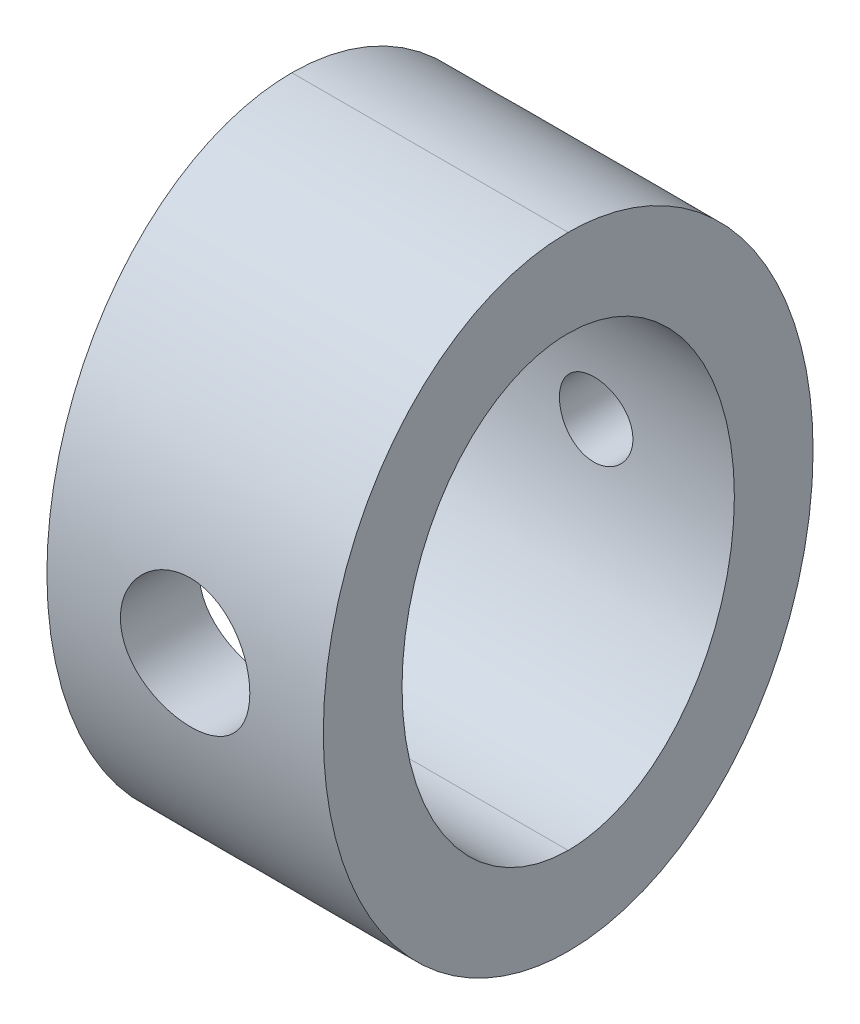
ISO-10303-21;
HEADER;
FILE_DESCRIPTION(('STEP AP214'),'2;1');
FILE_NAME('part.step','',(''),(''),'','','');
FILE_SCHEMA(('AUTOMOTIVE_DESIGN { 1 0 10303 214 1 1 1 1 }'));
ENDSEC;
DATA;
#1=APPLICATION_CONTEXT('core data for automotive mechanical design processes');
#2=APPLICATION_PROTOCOL_DEFINITION('international standard','automotive_design',2000,#1);
#3=PRODUCT_CONTEXT('',#1,'mechanical');
#4=PRODUCT('Part','Part','',(#3));
#5=PRODUCT_RELATED_PRODUCT_CATEGORY('part','',(#4));
#6=PRODUCT_DEFINITION_FORMATION('','',#4);
#7=PRODUCT_DEFINITION_CONTEXT('part definition',#1,'design');
#8=PRODUCT_DEFINITION('design','',#6,#7);
#9=PRODUCT_DEFINITION_SHAPE('','',#8);
#10=(LENGTH_UNIT() NAMED_UNIT(*) SI_UNIT(.MILLI.,.METRE.));
#11=(NAMED_UNIT(*) PLANE_ANGLE_UNIT() SI_UNIT($,.RADIAN.));
#12=(NAMED_UNIT(*) SI_UNIT($,.STERADIAN.) SOLID_ANGLE_UNIT());
#13=UNCERTAINTY_MEASURE_WITH_UNIT(LENGTH_MEASURE(1.E-05),#10,'distance_accuracy_value','');
#14=(GEOMETRIC_REPRESENTATION_CONTEXT(3) GLOBAL_UNCERTAINTY_ASSIGNED_CONTEXT((#13)) GLOBAL_UNIT_ASSIGNED_CONTEXT((#10,
#11,#12)) REPRESENTATION_CONTEXT('',''));
#15=CARTESIAN_POINT('',(0.,0.,0.));
#16=DIRECTION('',(0.,0.,1.));
#17=DIRECTION('',(1.,0.,0.));
#18=AXIS2_PLACEMENT_3D('',#15,#16,#17);
#19=CARTESIAN_POINT('',(0.,-0.126999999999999,37.846));
#20=DIRECTION('',(0.,0.,-1.));
#21=DIRECTION('',(0.,1.,0.));
#22=AXIS2_PLACEMENT_3D('',#19,#20,#21);
#23=CYLINDRICAL_SURFACE('',#22,4.699);
#24=CARTESIAN_POINT('',(2.81771134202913E-11,-4.826,35.1501131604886));
#25=CARTESIAN_POINT('',(0.130875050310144,-4.82599933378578,35.1501134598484));
#26=CARTESIAN_POINT('',(0.261768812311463,-4.82052771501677,35.1510554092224));
#27=CARTESIAN_POINT('',(0.522667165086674,-4.79867725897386,35.1547973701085));
#28=CARTESIAN_POINT('',(0.652671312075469,-4.78229332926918,35.1575982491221));
#29=CARTESIAN_POINT('',(0.911019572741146,-4.73870590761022,35.16498322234));
#30=CARTESIAN_POINT('',(1.0393606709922,-4.71148500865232,35.1695701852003));
#31=CARTESIAN_POINT('',(1.29330053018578,-4.64642051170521,35.1803965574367));
#32=CARTESIAN_POINT('',(1.41889822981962,-4.60857287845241,35.1866365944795));
#33=CARTESIAN_POINT('',(1.66621225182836,-4.52261684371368,35.2005776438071));
#34=CARTESIAN_POINT('',(1.78793468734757,-4.47452562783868,35.2082762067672));
#35=CARTESIAN_POINT('',(2.02691890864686,-4.36837977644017,35.2249264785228));
#36=CARTESIAN_POINT('',(2.14417902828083,-4.31032146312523,35.2338786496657));
#37=CARTESIAN_POINT('',(2.37330346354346,-4.18471948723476,35.2527766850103));
#38=CARTESIAN_POINT('',(2.48517177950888,-4.11718300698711,35.262721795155));
#39=CARTESIAN_POINT('',(2.70289221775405,-3.97304031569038,35.2833410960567));
#40=CARTESIAN_POINT('',(2.80874208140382,-3.8964307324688,35.2940155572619));
#41=CARTESIAN_POINT('',(3.0145748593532,-3.73397659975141,35.3158955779));
#42=CARTESIAN_POINT('',(3.11449776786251,-3.64805653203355,35.3271049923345));
#43=CARTESIAN_POINT('',(3.30680471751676,-3.46810627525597,35.3496629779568));
#44=CARTESIAN_POINT('',(3.39918596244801,-3.37407310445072,35.3610115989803));
#45=CARTESIAN_POINT('',(3.57571302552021,-3.17859247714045,35.3835323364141));
#46=CARTESIAN_POINT('',(3.65986083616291,-3.07714682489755,35.394704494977));
#47=CARTESIAN_POINT('',(3.81939001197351,-2.86747798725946,35.4165771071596));
#48=CARTESIAN_POINT('',(3.89476832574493,-2.75925246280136,35.4272773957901));
#49=CARTESIAN_POINT('',(4.03663246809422,-2.53610510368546,35.4479786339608));
#50=CARTESIAN_POINT('',(4.10306014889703,-2.42114584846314,35.4579748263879));
#51=CARTESIAN_POINT('',(4.22598210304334,-2.18595180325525,35.4769232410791));
#52=CARTESIAN_POINT('',(4.28247644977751,-2.06571705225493,35.4858754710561));
#53=CARTESIAN_POINT('',(4.38511803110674,-1.82080409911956,35.5024957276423));
#54=CARTESIAN_POINT('',(4.43126392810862,-1.69612532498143,35.5101635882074));
#55=CARTESIAN_POINT('',(4.51283241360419,-1.44327666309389,35.524005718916));
#56=CARTESIAN_POINT('',(4.54825892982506,-1.3151080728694,35.530180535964));
#57=CARTESIAN_POINT('',(4.60788104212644,-1.05726538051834,35.5408314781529));
#58=CARTESIAN_POINT('',(4.63216955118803,-0.92761333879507,35.5453215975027));
#59=CARTESIAN_POINT('',(4.66975977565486,-0.666727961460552,35.5525616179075));
#60=CARTESIAN_POINT('',(4.68306568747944,-0.535495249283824,35.555312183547));
#61=CARTESIAN_POINT('',(4.69860288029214,-0.272308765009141,35.5590114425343));
#62=CARTESIAN_POINT('',(4.7008306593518,-0.140354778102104,35.5599595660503));
#63=CARTESIAN_POINT('',(4.69418380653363,0.123224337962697,35.5600378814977));
#64=CARTESIAN_POINT('',(4.6853133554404,0.254849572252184,35.5591687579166));
#65=CARTESIAN_POINT('',(4.65668395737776,0.515597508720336,35.5556677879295));
#66=CARTESIAN_POINT('',(4.63703107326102,0.644732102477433,35.5530530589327));
#67=CARTESIAN_POINT('',(4.58706718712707,0.90082764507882,35.5461632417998));
#68=CARTESIAN_POINT('',(4.55676012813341,1.02778937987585,35.5418887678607));
#69=CARTESIAN_POINT('',(4.48569914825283,1.27874459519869,35.5318063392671));
#70=CARTESIAN_POINT('',(4.4449412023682,1.40273691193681,35.5259977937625));
#71=CARTESIAN_POINT('',(4.35330111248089,1.64679697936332,35.5130206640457));
#72=CARTESIAN_POINT('',(4.30242255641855,1.76686610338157,35.5058525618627));
#73=CARTESIAN_POINT('',(4.19067185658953,2.00278293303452,35.4903296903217));
#74=CARTESIAN_POINT('',(4.12975977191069,2.1186114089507,35.4819701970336));
#75=CARTESIAN_POINT('',(3.99854351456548,2.34470665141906,35.4643289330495));
#76=CARTESIAN_POINT('',(3.92824152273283,2.45497470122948,35.4550473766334));
#77=CARTESIAN_POINT('',(3.77874739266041,2.669196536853,35.4358273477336));
#78=CARTESIAN_POINT('',(3.6995586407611,2.77315270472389,35.425889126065));
#79=CARTESIAN_POINT('',(3.53276748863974,2.97416905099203,35.405627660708));
#80=CARTESIAN_POINT('',(3.44515695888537,3.07122240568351,35.3953040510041));
#81=CARTESIAN_POINT('',(3.16864457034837,3.3529293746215,35.3639781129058));
#82=CARTESIAN_POINT('',(2.96760555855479,3.52591816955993,35.3428281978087));
#83=CARTESIAN_POINT('',(2.53917296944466,3.83571011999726,35.3026243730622));
#84=CARTESIAN_POINT('',(2.31178098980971,3.97251546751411,35.2835703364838));
#85=CARTESIAN_POINT('',(1.95556898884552,4.14781124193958,35.2582096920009));
#86=CARTESIAN_POINT('',(1.83405792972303,4.20133313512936,35.2502805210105));
#87=CARTESIAN_POINT('',(1.58694406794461,4.29790337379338,35.2357433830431));
#88=CARTESIAN_POINT('',(1.46134466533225,4.3409601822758,35.2291343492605));
#89=CARTESIAN_POINT('',(1.20709670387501,4.4162453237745,35.2174437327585));
#90=CARTESIAN_POINT('',(1.07845321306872,4.44849046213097,35.2123597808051));
#91=CARTESIAN_POINT('',(0.818871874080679,4.50199548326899,35.2038607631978));
#92=CARTESIAN_POINT('',(0.687934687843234,4.52325848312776,35.2004452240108));
#93=CARTESIAN_POINT('',(0.464054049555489,4.54995381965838,35.1961415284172));
#94=CARTESIAN_POINT('',(0.371446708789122,4.55821784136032,35.1948031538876));
#95=CARTESIAN_POINT('',(0.185896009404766,4.56924116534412,35.1930160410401));
#96=CARTESIAN_POINT('',(0.0929526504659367,4.57200046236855,35.1925673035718));
#97=CARTESIAN_POINT('',(-0.131001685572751,4.57199934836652,35.1925677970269));
#98=CARTESIAN_POINT('',(-0.262021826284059,4.56651717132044,35.1934597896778));
#99=CARTESIAN_POINT('',(-0.52317271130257,4.54462423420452,35.1970023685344));
#100=CARTESIAN_POINT('',(-0.653303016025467,4.52820841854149,35.1996537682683));
#101=CARTESIAN_POINT('',(-0.911903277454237,4.48453498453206,35.2066414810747));
#102=CARTESIAN_POINT('',(-1.04037022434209,4.45725995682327,35.2109804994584));
#103=CARTESIAN_POINT('',(-1.29456078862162,4.39206367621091,35.2212150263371));
#104=CARTESIAN_POINT('',(-1.42028334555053,4.35413838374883,35.2271111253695));
#105=CARTESIAN_POINT('',(-1.66784992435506,4.26800024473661,35.2402725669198));
#106=CARTESIAN_POINT('',(-1.78969988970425,4.21980413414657,35.2475356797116));
#107=CARTESIAN_POINT('',(-2.02893307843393,4.11342162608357,35.2632263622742));
#108=CARTESIAN_POINT('',(-2.14631463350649,4.05523154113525,35.2716543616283));
#109=CARTESIAN_POINT('',(-2.37567152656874,3.92933903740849,35.2894200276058));
#110=CARTESIAN_POINT('',(-2.48765088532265,3.86164384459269,35.2987570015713));
#111=CARTESIAN_POINT('',(-2.70557878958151,3.71715703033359,35.3180798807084));
#112=CARTESIAN_POINT('',(-2.81152507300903,3.64036202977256,35.3280660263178));
#113=CARTESIAN_POINT('',(-3.01744181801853,3.47758140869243,35.3484787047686));
#114=CARTESIAN_POINT('',(-3.11735809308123,3.39152759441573,35.3589081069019));
#115=CARTESIAN_POINT('',(-3.30964018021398,3.21130091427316,35.3798340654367));
#116=CARTESIAN_POINT('',(-3.40200318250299,3.11712505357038,35.3903306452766));
#117=CARTESIAN_POINT('',(-3.57847683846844,2.92135479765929,35.4110813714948));
#118=CARTESIAN_POINT('',(-3.66258964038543,2.81976234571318,35.4213355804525));
#119=CARTESIAN_POINT('',(-3.82203257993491,2.60979589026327,35.4413123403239));
#120=CARTESIAN_POINT('',(-3.89735946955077,2.50141940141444,35.451034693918));
#121=CARTESIAN_POINT('',(-4.0389946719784,2.27813672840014,35.4697063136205));
#122=CARTESIAN_POINT('',(-4.1052587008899,2.16320211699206,35.4786517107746));
#123=CARTESIAN_POINT('',(-4.22788499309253,1.92803897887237,35.4954580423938));
#124=CARTESIAN_POINT('',(-4.28424355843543,1.80780849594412,35.5033185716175));
#125=CARTESIAN_POINT('',(-4.38658747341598,1.56298021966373,35.5177140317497));
#126=CARTESIAN_POINT('',(-4.43257729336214,1.43838433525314,35.5242495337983));
#127=CARTESIAN_POINT('',(-4.51388010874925,1.1856886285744,35.5358069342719));
#128=CARTESIAN_POINT('',(-4.54918914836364,1.05758752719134,35.5408282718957));
#129=CARTESIAN_POINT('',(-4.63806028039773,0.671738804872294,35.5532864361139));
#130=CARTESIAN_POINT('',(-4.67561290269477,0.409934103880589,35.5582698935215));
#131=CARTESIAN_POINT('',(-4.69869222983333,0.0156761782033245,35.5603004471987));
#132=CARTESIAN_POINT('',(-4.70083593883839,-0.116072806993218,35.5600682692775));
#133=CARTESIAN_POINT('',(-4.69406494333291,-0.379259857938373,35.5577975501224));
#134=CARTESIAN_POINT('',(-4.68515531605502,-0.510698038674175,35.5557598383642));
#135=CARTESIAN_POINT('',(-4.65646454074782,-0.771184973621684,35.549944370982));
#136=CARTESIAN_POINT('',(-4.63677749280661,-0.900244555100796,35.5461817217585));
#137=CARTESIAN_POINT('',(-4.58676169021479,-1.15617852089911,35.5370160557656));
#138=CARTESIAN_POINT('',(-4.55643690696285,-1.28305370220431,35.5316136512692));
#139=CARTESIAN_POINT('',(-4.48535792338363,-1.53382558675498,35.5193014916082));
#140=CARTESIAN_POINT('',(-4.4445996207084,-1.6577210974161,35.5123911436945));
#141=CARTESIAN_POINT('',(-4.35297794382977,-1.90158267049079,35.4972444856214));
#142=CARTESIAN_POINT('',(-4.30211814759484,-2.02155010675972,35.4890086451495));
#143=CARTESIAN_POINT('',(-4.19035052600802,-2.25741949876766,35.4713745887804));
#144=CARTESIAN_POINT('',(-4.12938980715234,-2.37329593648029,35.461970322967));
#145=CARTESIAN_POINT('',(-3.99807636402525,-2.59946424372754,35.442285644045));
#146=CARTESIAN_POINT('',(-3.92772697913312,-2.7097580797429,35.4320055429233));
#147=CARTESIAN_POINT('',(-3.77808586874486,-2.92409808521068,35.4108337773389));
#148=CARTESIAN_POINT('',(-3.6987910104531,-3.0281420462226,35.3999418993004));
#149=CARTESIAN_POINT('',(-3.53185511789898,-3.2292037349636,35.3778428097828));
#150=CARTESIAN_POINT('',(-3.44421706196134,-3.32622394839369,35.3666357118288));
#151=CARTESIAN_POINT('',(-3.26005692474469,-3.51375485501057,35.3440655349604));
#152=CARTESIAN_POINT('',(-3.16344018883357,-3.60417259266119,35.3327022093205));
#153=CARTESIAN_POINT('',(-2.96294479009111,-3.77652447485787,35.3102720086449));
#154=CARTESIAN_POINT('',(-2.85906877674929,-3.85846168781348,35.2992050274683));
#155=CARTESIAN_POINT('',(-2.64464873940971,-4.01337905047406,35.2776618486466));
#156=CARTESIAN_POINT('',(-2.534099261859,-4.08635172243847,35.2671861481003));
#157=CARTESIAN_POINT('',(-2.30721791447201,-4.2227120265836,35.2471342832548));
#158=CARTESIAN_POINT('',(-2.19088825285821,-4.28610328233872,35.237557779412));
#159=CARTESIAN_POINT('',(-1.95299278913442,-4.40298142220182,35.2195555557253));
#160=CARTESIAN_POINT('',(-1.83141745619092,-4.45644925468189,35.2111320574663));
#161=CARTESIAN_POINT('',(-1.58414574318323,-4.55291093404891,35.1957043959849));
#162=CARTESIAN_POINT('',(-1.45845098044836,-4.59590883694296,35.1886996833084));
#163=CARTESIAN_POINT('',(-1.20401632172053,-4.67106358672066,35.1763211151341));
#164=CARTESIAN_POINT('',(-1.07528193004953,-4.70323862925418,35.170944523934));
#165=CARTESIAN_POINT('',(-0.815545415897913,-4.75658430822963,35.1619671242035));
#166=CARTESIAN_POINT('',(-0.68454442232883,-4.77776026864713,35.1583654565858));
#167=CARTESIAN_POINT('',(-0.461170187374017,-4.80422751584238,35.1538484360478));
#168=CARTESIAN_POINT('',(-0.369136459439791,-4.81238895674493,35.1524495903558));
#169=CARTESIAN_POINT('',(-0.184738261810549,-4.82327543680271,35.1505818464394));
#170=CARTESIAN_POINT('',(-0.0923737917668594,-4.8260004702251,35.1501129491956));
#171=CARTESIAN_POINT('',(2.81771134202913E-11,-4.826,35.1501131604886));
#172=B_SPLINE_CURVE_WITH_KNOTS('',3,(#24,#25,#26,#27,#28,#29,#30,#31,#32,#33,#34,#35,#36,#37,
#38,#39,#40,#41,#42,#43,#44,#45,#46,#47,#48,#49,#50,#51,#52,#53,#54,#55,#56,#57,#58,#59,#60,#61,
#62,#63,#64,#65,#66,#67,#68,#69,#70,#71,#72,#73,#74,#75,#76,#77,#78,#79,#80,#81,#82,#83,#84,#85,
#86,#87,#88,#89,#90,#91,#92,#93,#94,#95,#96,#97,#98,#99,#100,#101,#102,#103,#104,#105,#106,#107,
#108,#109,#110,#111,#112,#113,#114,#115,#116,#117,#118,#119,#120,#121,#122,#123,#124,#125,#126,
#127,#128,#129,#130,#131,#132,#133,#134,#135,#136,#137,#138,#139,#140,#141,#142,#143,#144,#145,
#146,#147,#148,#149,#150,#151,#152,#153,#154,#155,#156,#157,#158,#159,#160,#161,#162,#163,#164,
#165,#166,#167,#168,#169,#170,#171),.UNSPECIFIED.,.T.,.F.,(4,2,2,2,2,2,2,2,2,2,2,2,2,2,2,2,2,2,
2,2,2,2,2,2,2,2,2,2,2,2,2,2,2,2,2,2,2,2,2,2,2,2,2,2,2,2,2,2,2,2,2,2,2,2,2,2,2,2,2,2,2,2,2,2,2,2,
2,2,2,2,2,2,2,4),(0.,0.392540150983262,0.78526361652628,1.17862046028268,1.57212687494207,
1.96497823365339,2.35797486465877,2.75067528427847,3.14352211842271,3.53983513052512,
3.93629442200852,4.33265753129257,4.72915814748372,5.1281217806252,5.52708246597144,
5.92609468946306,6.32496053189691,6.7204356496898,7.1157595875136,7.51120848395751,
7.90650845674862,8.29798796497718,8.68932274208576,9.08080846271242,9.47215564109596,
9.86510008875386,10.2579534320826,10.6506575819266,11.043744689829,11.8379329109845,
12.6320730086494,13.0307085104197,13.4290205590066,13.8267105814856,14.2242876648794,
14.5030847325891,14.781882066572,15.174801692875,15.5679031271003,15.9616373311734,
16.3555210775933,16.7487678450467,17.142160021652,17.5352547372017,17.9284958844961,
18.3248624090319,18.7213757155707,19.1177854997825,19.5143413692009,19.912770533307,
20.3113481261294,20.7097535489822,21.1083063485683,21.897336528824,22.2922761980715,
22.6870345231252,23.0783998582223,23.469619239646,23.8609926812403,24.2522277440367,
24.6455803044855,25.0387933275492,25.4321444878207,25.8253557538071,26.2233242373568,
26.6211482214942,27.0193018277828,27.4173044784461,27.8160635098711,28.2146678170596,
28.6125985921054,29.0103365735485,29.2873976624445,29.5644590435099),.UNSPECIFIED.);
#173=CARTESIAN_POINT('',(2.81771134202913E-11,-4.826,35.1501131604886));
#174=VERTEX_POINT('',#173);
#175=EDGE_CURVE('E81',#174,#174,#172,.T.);
#176=ORIENTED_EDGE('',*,*,#175,.T.);
#177=EDGE_LOOP('',(#176));
#178=FACE_BOUND('',#177,.T.);
#179=CARTESIAN_POINT('',(0.,4.572,29.3579906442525));
#180=CARTESIAN_POINT('',(-0.130310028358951,4.57199942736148,29.3579909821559));
#181=CARTESIAN_POINT('',(-0.260634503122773,4.5665748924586,29.3591730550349));
#182=CARTESIAN_POINT('',(-0.520389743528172,4.54491522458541,29.3638661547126));
#183=CARTESIAN_POINT('',(-0.649820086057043,4.52867528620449,29.3673782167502));
#184=CARTESIAN_POINT('',(-0.907004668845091,4.48547990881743,29.3766294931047));
#185=CARTESIAN_POINT('',(-1.03475603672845,4.45850808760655,29.3823721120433));
#186=CARTESIAN_POINT('',(-1.28751781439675,4.39405263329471,29.3959091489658));
#187=CARTESIAN_POINT('',(-1.41252715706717,4.35656498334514,29.4037043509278));
#188=CARTESIAN_POINT('',(-1.65864498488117,4.27145650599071,29.4210905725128));
#189=CARTESIAN_POINT('',(-1.77976054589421,4.22385541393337,29.4306780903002));
#190=CARTESIAN_POINT('',(-2.01756420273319,4.11881421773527,29.45137588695));
#191=CARTESIAN_POINT('',(-2.13425064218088,4.06137047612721,29.4624867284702));
#192=CARTESIAN_POINT('',(-2.36229191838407,3.93711454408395,29.485893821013));
#193=CARTESIAN_POINT('',(-2.47365039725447,3.87030887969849,29.498189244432));
#194=CARTESIAN_POINT('',(-2.6904332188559,3.7277382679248,29.5236222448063));
#195=CARTESIAN_POINT('',(-2.79585532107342,3.65196997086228,29.5367601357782));
#196=CARTESIAN_POINT('',(-3.00148330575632,3.49087207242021,29.5636906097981));
#197=CARTESIAN_POINT('',(-3.10159413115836,3.40542222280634,29.5774898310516));
#198=CARTESIAN_POINT('',(-3.29432794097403,3.22640269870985,29.6051740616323));
#199=CARTESIAN_POINT('',(-3.38694813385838,3.13283002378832,29.619059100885));
#200=CARTESIAN_POINT('',(-3.56401256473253,2.9382430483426,29.6465097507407));
#201=CARTESIAN_POINT('',(-3.64845879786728,2.83723057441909,29.6600754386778));
#202=CARTESIAN_POINT('',(-3.80864902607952,2.62838015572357,29.6865099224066));
#203=CARTESIAN_POINT('',(-3.88438980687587,2.52053971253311,29.6993784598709));
#204=CARTESIAN_POINT('',(-4.02720874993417,2.29783779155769,29.7241528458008));
#205=CARTESIAN_POINT('',(-4.09420693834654,2.18292397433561,29.7360494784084));
#206=CARTESIAN_POINT('',(-4.2182950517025,1.94767574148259,29.7584133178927));
#207=CARTESIAN_POINT('',(-4.27538125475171,1.82733931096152,29.7688799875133));
#208=CARTESIAN_POINT('',(-4.37915189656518,1.58219176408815,29.7880659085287));
#209=CARTESIAN_POINT('',(-4.42584116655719,1.45738275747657,29.7967859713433));
#210=CARTESIAN_POINT('',(-4.50849731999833,1.20409315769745,29.8122271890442));
#211=CARTESIAN_POINT('',(-4.54446032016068,1.07561125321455,29.8189476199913));
#212=CARTESIAN_POINT('',(-4.60486211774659,0.818017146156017,29.8300888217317));
#213=CARTESIAN_POINT('',(-4.6294749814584,0.688947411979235,29.8345444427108));
#214=CARTESIAN_POINT('',(-4.66782585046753,0.42913176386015,29.8411826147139));
#215=CARTESIAN_POINT('',(-4.68155985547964,0.298385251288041,29.8433643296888));
#216=CARTESIAN_POINT('',(-4.70620153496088,-0.0948156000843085,29.846354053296));
#217=CARTESIAN_POINT('',(-4.70062156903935,-0.358542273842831,29.8436204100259));
#218=CARTESIAN_POINT('',(-4.64599071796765,-0.876913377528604,29.8289515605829));
#219=CARTESIAN_POINT('',(-4.59760921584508,-1.13163509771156,29.8171584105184));
#220=CARTESIAN_POINT('',(-4.45986400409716,-1.62927193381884,29.7856793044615));
#221=CARTESIAN_POINT('',(-4.37049807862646,-1.87218641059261,29.7659929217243));
#222=CARTESIAN_POINT('',(-4.15261302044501,-2.34148359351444,29.7204921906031));
#223=CARTESIAN_POINT('',(-4.02378382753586,-2.56771711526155,29.6946296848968));
#224=CARTESIAN_POINT('',(-3.73074829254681,-2.99567414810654,29.6394655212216));
#225=CARTESIAN_POINT('',(-3.56653959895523,-3.19739602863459,29.610163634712));
#226=CARTESIAN_POINT('',(-3.29540124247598,-3.47938444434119,29.5656238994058));
#227=CARTESIAN_POINT('',(-3.19975879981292,-3.57078400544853,29.5505198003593));
#228=CARTESIAN_POINT('',(-3.00109570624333,-3.74521340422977,29.5206204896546));
#229=CARTESIAN_POINT('',(-2.89807770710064,-3.82824622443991,29.5058251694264));
#230=CARTESIAN_POINT('',(-2.68525955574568,-3.98543293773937,29.4769416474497));
#231=CARTESIAN_POINT('',(-2.57545385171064,-4.05957941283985,29.4628540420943));
#232=CARTESIAN_POINT('',(-2.34991418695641,-4.19836671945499,29.435803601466));
#233=CARTESIAN_POINT('',(-2.23418252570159,-4.26301120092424,29.4228403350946));
#234=CARTESIAN_POINT('',(-1.99710897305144,-4.38256651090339,29.3983641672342));
#235=CARTESIAN_POINT('',(-1.87574803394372,-4.43744070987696,29.386856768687));
#236=CARTESIAN_POINT('',(-1.62871314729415,-4.53671730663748,29.3656966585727));
#237=CARTESIAN_POINT('',(-1.50304093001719,-4.5811238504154,29.3560432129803));
#238=CARTESIAN_POINT('',(-1.24845973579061,-4.65906823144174,29.3388947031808));
#239=CARTESIAN_POINT('',(-1.11955656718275,-4.6926242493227,29.331396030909));
#240=CARTESIAN_POINT('',(-0.859307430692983,-4.74867683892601,29.3187713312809));
#241=CARTESIAN_POINT('',(-0.72796266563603,-4.7711787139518,29.3136441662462));
#242=CARTESIAN_POINT('',(-0.497124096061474,-4.80069078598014,29.3068928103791));
#243=CARTESIAN_POINT('',(-0.397955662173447,-4.81017723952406,29.3047111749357));
#244=CARTESIAN_POINT('',(-0.199194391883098,-4.82283207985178,29.3017975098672));
#245=CARTESIAN_POINT('',(-0.0996015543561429,-4.82600044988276,29.3010654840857));
#246=CARTESIAN_POINT('',(0.130083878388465,-4.82599941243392,29.3010661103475));
#247=CARTESIAN_POINT('',(0.260182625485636,-4.82059361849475,29.3023155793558));
#248=CARTESIAN_POINT('',(0.519486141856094,-4.79900943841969,29.3072774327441));
#249=CARTESIAN_POINT('',(0.648690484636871,-4.78282622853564,29.3109909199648));
#250=CARTESIAN_POINT('',(0.9054238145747,-4.73978384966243,29.3207767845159));
#251=CARTESIAN_POINT('',(1.03294991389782,-4.71290827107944,29.3268527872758));
#252=CARTESIAN_POINT('',(1.28526274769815,-4.64868713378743,29.3411842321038));
#253=CARTESIAN_POINT('',(1.41004841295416,-4.61133756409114,29.3494405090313));
#254=CARTESIAN_POINT('',(1.65571351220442,-4.52655279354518,29.3678692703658));
#255=CARTESIAN_POINT('',(1.77660033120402,-4.47913812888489,29.3780378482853));
#256=CARTESIAN_POINT('',(2.01395718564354,-4.37451754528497,29.4000134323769));
#257=CARTESIAN_POINT('',(2.1304255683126,-4.31730800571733,29.4118210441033));
#258=CARTESIAN_POINT('',(2.35804951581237,-4.19356763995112,29.4367305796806));
#259=CARTESIAN_POINT('',(2.46920868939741,-4.12704326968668,29.4498316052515));
#260=CARTESIAN_POINT('',(2.6856174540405,-3.98508446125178,29.4769788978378));
#261=CARTESIAN_POINT('',(2.79086481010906,-3.9096466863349,29.4910255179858));
#262=CARTESIAN_POINT('',(2.99634354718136,-3.74912389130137,29.5199077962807));
#263=CARTESIAN_POINT('',(3.09646973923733,-3.6639055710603,29.5347524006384));
#264=CARTESIAN_POINT('',(3.28923582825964,-3.48539488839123,29.5646183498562));
#265=CARTESIAN_POINT('',(3.38187293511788,-3.3920995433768,29.5796397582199));
#266=CARTESIAN_POINT('',(3.6475383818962,-3.1010404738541,29.6243495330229));
#267=CARTESIAN_POINT('',(3.80851368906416,-2.89195279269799,29.6537117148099));
#268=CARTESIAN_POINT('',(4.09497951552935,-2.44704570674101,29.7087082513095));
#269=CARTESIAN_POINT('',(4.22005182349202,-2.21095280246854,29.7342971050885));
#270=CARTESIAN_POINT('',(4.42860731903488,-1.72042385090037,29.7786408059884));
#271=CARTESIAN_POINT('',(4.51209523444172,-1.46598989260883,29.7973964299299));
#272=CARTESIAN_POINT('',(4.63381114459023,-0.950142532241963,29.8258797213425));
#273=CARTESIAN_POINT('',(4.67271005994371,-0.688894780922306,29.8357407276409));
#274=CARTESIAN_POINT('',(4.70622631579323,-0.163399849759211,29.8459666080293));
#275=CARTESIAN_POINT('',(4.70084867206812,0.100846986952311,29.8463325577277));
#276=CARTESIAN_POINT('',(4.64645069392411,0.620046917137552,29.8377351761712));
#277=CARTESIAN_POINT('',(4.59817923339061,0.875081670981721,29.8289314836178));
#278=CARTESIAN_POINT('',(4.46052318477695,1.37338001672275,29.8032946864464));
#279=CARTESIAN_POINT('',(4.37113685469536,1.61664310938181,29.7864612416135));
#280=CARTESIAN_POINT('',(4.15330917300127,2.08615191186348,29.7465334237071));
#281=CARTESIAN_POINT('',(4.02463950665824,2.31228822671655,29.7234025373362));
#282=CARTESIAN_POINT('',(3.73194988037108,2.74009708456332,29.6734548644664));
#283=CARTESIAN_POINT('',(3.56792785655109,2.94176819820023,29.6466378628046));
#284=CARTESIAN_POINT('',(3.29718113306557,3.22362624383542,29.6056171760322));
#285=CARTESIAN_POINT('',(3.20173269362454,3.31494107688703,29.5916677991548));
#286=CARTESIAN_POINT('',(3.00348448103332,3.4892232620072,29.5639832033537));
#287=CARTESIAN_POINT('',(2.9006873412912,3.57219357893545,29.550247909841));
#288=CARTESIAN_POINT('',(2.68833946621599,3.72928015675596,29.523379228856));
#289=CARTESIAN_POINT('',(2.57878320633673,3.8033890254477,29.5102463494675));
#290=CARTESIAN_POINT('',(2.35377048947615,3.94213083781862,29.4849872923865));
#291=CARTESIAN_POINT('',(2.23831629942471,4.00676738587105,29.4728607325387));
#292=CARTESIAN_POINT('',(2.00166290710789,4.12642408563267,29.449916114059));
#293=CARTESIAN_POINT('',(1.88043763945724,4.18139403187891,29.4391049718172));
#294=CARTESIAN_POINT('',(1.63368563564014,4.28087475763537,29.4192015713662));
#295=CARTESIAN_POINT('',(1.5081606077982,4.32538963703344,29.4101086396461));
#296=CARTESIAN_POINT('',(1.25387891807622,4.40356876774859,29.3939363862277));
#297=CARTESIAN_POINT('',(1.12512795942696,4.43725088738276,29.386853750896));
#298=CARTESIAN_POINT('',(0.865185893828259,4.49357653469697,29.3749111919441));
#299=CARTESIAN_POINT('',(0.73399597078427,4.51622528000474,29.3700502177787));
#300=CARTESIAN_POINT('',(0.502293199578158,4.5461603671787,29.3635981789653));
#301=CARTESIAN_POINT('',(0.402097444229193,4.55584565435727,29.3614988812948));
#302=CARTESIAN_POINT('',(0.201270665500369,4.56876569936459,29.3586949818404));
#303=CARTESIAN_POINT('',(0.100639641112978,4.57200044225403,29.3579903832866));
#304=CARTESIAN_POINT('',(0.,4.572,29.3579906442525));
#305=B_SPLINE_CURVE_WITH_KNOTS('',3,(#179,#180,#181,#182,#183,#184,#185,#186,#187,#188,#189,
#190,#191,#192,#193,#194,#195,#196,#197,#198,#199,#200,#201,#202,#203,#204,#205,#206,#207,#208,
#209,#210,#211,#212,#213,#214,#215,#216,#217,#218,#219,#220,#221,#222,#223,#224,#225,#226,#227,
#228,#229,#230,#231,#232,#233,#234,#235,#236,#237,#238,#239,#240,#241,#242,#243,#244,#245,#246,
#247,#248,#249,#250,#251,#252,#253,#254,#255,#256,#257,#258,#259,#260,#261,#262,#263,#264,#265,
#266,#267,#268,#269,#270,#271,#272,#273,#274,#275,#276,#277,#278,#279,#280,#281,#282,#283,#284,
#285,#286,#287,#288,#289,#290,#291,#292,#293,#294,#295,#296,#297,#298,#299,#300,#301,#302,#303,
#304),.UNSPECIFIED.,.T.,.F.,(4,2,2,2,2,2,2,2,2,2,2,2,2,2,2,2,2,2,2,2,2,2,2,2,2,2,2,2,2,2,2,2,2,
2,2,2,2,2,2,2,2,2,2,2,2,2,2,2,2,2,2,2,2,2,2,2,2,2,2,2,2,2,4),(0.,0.390837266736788,
0.781848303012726,1.17345852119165,1.56521853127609,1.95622097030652,2.34736822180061,
2.73824415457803,3.12926663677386,3.52582874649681,3.92253796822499,4.31915011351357,
4.71590823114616,5.11607343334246,5.51638857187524,5.9165173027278,6.31679071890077,
6.71070274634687,7.10475955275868,7.89192654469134,8.66699628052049,9.44210792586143,
10.2234729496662,11.0048899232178,11.4039602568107,11.8028878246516,12.2021461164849,
12.6012506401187,13.0018212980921,13.4022330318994,13.8019703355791,14.2015156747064,
14.5002490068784,14.7989831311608,15.1891426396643,15.5794768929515,15.97041251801,
16.3614980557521,16.7517931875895,17.1422329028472,17.5324033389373,17.9227203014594,
18.3191884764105,18.7158036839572,19.5083036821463,20.3096916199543,21.1109884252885,
21.9000631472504,22.6890484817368,23.46452395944,24.2400322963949,25.020136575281,
25.8002864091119,26.1983872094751,26.5963460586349,26.9946346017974,27.3927711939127,
27.7929181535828,28.1929079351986,28.5922345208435,28.9913720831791,29.2932186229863,
29.595065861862),.UNSPECIFIED.);
#306=CARTESIAN_POINT('',(0.,4.572,29.3579906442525));
#307=VERTEX_POINT('',#306);
#308=EDGE_CURVE('E18',#307,#307,#305,.T.);
#309=ORIENTED_EDGE('',*,*,#308,.F.);
#310=EDGE_LOOP('',(#309));
#311=FACE_BOUND('',#310,.T.);
#312=ADVANCED_FACE('F14',(#178,#311),#23,.F.);
#313=CARTESIAN_POINT('',(10.033,16.256,17.78));
#314=CARTESIAN_POINT('',(-10.033,16.256,17.78));
#315=CARTESIAN_POINT('',(10.033,16.256,41.91));
#316=CARTESIAN_POINT('',(-10.033,16.256,41.91));
#317=CARTESIAN_POINT('',(10.033,-16.256,41.91));
#318=CARTESIAN_POINT('',(-10.033,-16.256,41.91));
#319=CARTESIAN_POINT('',(10.033,-16.256,17.78));
#320=CARTESIAN_POINT('',(-10.033,-16.256,17.78));
#321=(BOUNDED_SURFACE() B_SPLINE_SURFACE(3,1,((#313,#314),(#315,#316),(#317,#318),(#319,#320)),
.UNSPECIFIED.,.F.,.F.,.F.) B_SPLINE_SURFACE_WITH_KNOTS((4,4),(2,2),(0.,1.),(0.,1.),
.UNSPECIFIED.) GEOMETRIC_REPRESENTATION_ITEM() RATIONAL_B_SPLINE_SURFACE(((1.,1.),
(0.333333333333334,0.333333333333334),(0.333333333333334,0.333333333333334),(1.,1.))) REPRESENTATION_ITEM('') SURFACE());
#322=CARTESIAN_POINT('',(-10.033,-16.256,17.78));
#323=CARTESIAN_POINT('',(-10.033,-16.2560020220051,17.9134717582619));
#324=CARTESIAN_POINT('',(-10.033,-16.2530150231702,18.0469251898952));
#325=CARTESIAN_POINT('',(-10.033,-16.2410902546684,18.3135597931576));
#326=CARTESIAN_POINT('',(-10.033,-16.2321527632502,18.446740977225));
#327=CARTESIAN_POINT('',(-10.033,-16.1964739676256,18.8453299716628));
#328=CARTESIAN_POINT('',(-10.033,-16.160866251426,19.1099963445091));
#329=CARTESIAN_POINT('',(-10.033,-16.0669620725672,19.6333937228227));
#330=CARTESIAN_POINT('',(-10.033,-16.0088186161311,19.8921525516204));
#331=CARTESIAN_POINT('',(-10.033,-15.8708215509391,20.4038346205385));
#332=CARTESIAN_POINT('',(-10.033,-15.7909657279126,20.6567572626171));
#333=CARTESIAN_POINT('',(-10.033,-15.6110229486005,21.1546141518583));
#334=CARTESIAN_POINT('',(-10.033,-15.5109830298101,21.399565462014));
#335=CARTESIAN_POINT('',(-10.033,-15.2919545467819,21.8809392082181));
#336=CARTESIAN_POINT('',(-10.033,-15.1729582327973,22.1173581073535));
#337=CARTESIAN_POINT('',(-10.033,-14.9174079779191,22.5808962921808));
#338=CARTESIAN_POINT('',(-10.033,-14.780830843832,22.8080027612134));
#339=CARTESIAN_POINT('',(-10.033,-14.491788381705,23.2518890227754));
#340=CARTESIAN_POINT('',(-10.033,-14.3393197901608,23.468666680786));
#341=CARTESIAN_POINT('',(-10.033,-13.9575622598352,23.9740513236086));
#342=CARTESIAN_POINT('',(-10.033,-13.7215475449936,24.2575990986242));
#343=CARTESIAN_POINT('',(-10.033,-13.2255769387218,24.8029246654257));
#344=CARTESIAN_POINT('',(-10.033,-12.9656136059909,25.0646956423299));
#345=CARTESIAN_POINT('',(-10.033,-12.4248568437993,25.5665387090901));
#346=CARTESIAN_POINT('',(-10.033,-12.1440328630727,25.8065777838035));
#347=CARTESIAN_POINT('',(-10.033,-11.565001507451,26.2645810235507));
#348=CARTESIAN_POINT('',(-10.033,-11.266793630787,26.4825445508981));
#349=CARTESIAN_POINT('',(-10.033,-10.5561221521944,26.9641532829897));
#350=CARTESIAN_POINT('',(-10.033,-10.138067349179,27.2195699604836));
#351=CARTESIAN_POINT('',(-10.033,-9.28133709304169,27.693129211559));
#352=CARTESIAN_POINT('',(-10.033,-8.84265506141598,27.9112597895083));
#353=CARTESIAN_POINT('',(-10.033,-7.94894196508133,28.3113310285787));
#354=CARTESIAN_POINT('',(-10.033,-7.4939045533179,28.4932574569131));
#355=CARTESIAN_POINT('',(-10.033,-6.57135848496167,28.8218080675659));
#356=CARTESIAN_POINT('',(-10.033,-6.10385080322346,28.9684350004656));
#357=CARTESIAN_POINT('',(-10.033,-5.14948100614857,29.2300208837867));
#358=CARTESIAN_POINT('',(-10.033,-4.6624186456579,29.3442469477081));
#359=CARTESIAN_POINT('',(-10.033,-3.68139947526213,29.5375807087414));
#360=CARTESIAN_POINT('',(-10.033,-3.18744258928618,29.6166880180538));
#361=CARTESIAN_POINT('',(-10.033,-2.19504089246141,29.7403365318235));
#362=CARTESIAN_POINT('',(-10.033,-1.69659444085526,29.7848645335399));
#363=CARTESIAN_POINT('',(-10.033,-0.697809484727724,29.8396077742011));
#364=CARTESIAN_POINT('',(-10.033,-0.197470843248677,29.8498204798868));
#365=CARTESIAN_POINT('',(-10.033,0.902168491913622,29.8346235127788));
#366=CARTESIAN_POINT('',(-10.033,1.5013810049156,29.8017333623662));
#367=CARTESIAN_POINT('',(-10.033,2.69515460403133,29.6864104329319));
#368=CARTESIAN_POINT('',(-10.033,3.28971466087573,29.6039669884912));
#369=CARTESIAN_POINT('',(-10.033,4.4695557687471,29.3887609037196));
#370=CARTESIAN_POINT('',(-10.033,5.054838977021,29.2560101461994));
#371=CARTESIAN_POINT('',(-10.033,6.21119837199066,28.938963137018));
#372=CARTESIAN_POINT('',(-10.033,6.78227957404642,28.7546853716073));
#373=CARTESIAN_POINT('',(-10.033,7.75874334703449,28.3877322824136));
#374=CARTESIAN_POINT('',(-10.033,8.16866055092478,28.2170557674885));
#375=CARTESIAN_POINT('',(-10.033,8.97477105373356,27.8457701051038));
#376=CARTESIAN_POINT('',(-10.033,9.37096498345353,27.6451623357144));
#377=CARTESIAN_POINT('',(-10.033,10.1458372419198,27.2134906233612));
#378=CARTESIAN_POINT('',(-10.033,10.5245357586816,26.9824630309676));
#379=CARTESIAN_POINT('',(-10.033,11.2609190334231,26.4890925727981));
#380=CARTESIAN_POINT('',(-10.033,11.6186109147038,26.2267604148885));
#381=CARTESIAN_POINT('',(-10.033,12.2267667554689,25.7361309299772));
#382=CARTESIAN_POINT('',(-10.033,12.482584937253,25.5144552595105));
#383=CARTESIAN_POINT('',(-10.033,12.9768996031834,25.0525097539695));
#384=CARTESIAN_POINT('',(-10.033,13.2153971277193,24.8122410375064));
#385=CARTESIAN_POINT('',(-10.033,13.6721973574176,24.3135051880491));
#386=CARTESIAN_POINT('',(-10.033,13.8905153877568,24.0550521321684));
#387=CARTESIAN_POINT('',(-10.033,14.30417554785,23.5203548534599));
#388=CARTESIAN_POINT('',(-10.033,14.4995222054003,23.2441141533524));
#389=CARTESIAN_POINT('',(-10.033,14.8315685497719,22.7256569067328));
#390=CARTESIAN_POINT('',(-10.033,14.972514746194,22.4861557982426));
#391=CARTESIAN_POINT('',(-10.033,15.2349570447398,21.9967405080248));
#392=CARTESIAN_POINT('',(-10.033,15.3564571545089,21.7468284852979));
#393=CARTESIAN_POINT('',(-10.033,15.5780939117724,21.2381517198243));
#394=CARTESIAN_POINT('',(-10.033,15.6782637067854,20.9794014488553));
#395=CARTESIAN_POINT('',(-10.033,15.8558399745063,20.4542260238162));
#396=CARTESIAN_POINT('',(-10.033,15.9332528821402,20.1878030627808));
#397=CARTESIAN_POINT('',(-10.033,16.0410068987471,19.7437726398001));
#398=CARTESIAN_POINT('',(-10.033,16.0783316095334,19.5678313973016));
#399=CARTESIAN_POINT('',(-10.033,16.1425461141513,19.2140816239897));
#400=CARTESIAN_POINT('',(-10.033,16.1694382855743,19.0362735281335));
#401=CARTESIAN_POINT('',(-10.033,16.2126032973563,18.679078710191));
#402=CARTESIAN_POINT('',(-10.033,16.2288587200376,18.4996898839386));
#403=CARTESIAN_POINT('',(-10.033,16.2505667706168,18.1402028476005));
#404=CARTESIAN_POINT('',(-10.033,16.2560159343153,17.9601044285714));
#405=CARTESIAN_POINT('',(-10.033,16.256,17.78));
#406=B_SPLINE_CURVE_WITH_KNOTS('',3,(#322,#323,#324,#325,#326,#327,#328,#329,#330,#331,#332,
#333,#334,#335,#336,#337,#338,#339,#340,#341,#342,#343,#344,#345,#346,#347,#348,#349,#350,#351,
#352,#353,#354,#355,#356,#357,#358,#359,#360,#361,#362,#363,#364,#365,#366,#367,#368,#369,#370,
#371,#372,#373,#374,#375,#376,#377,#378,#379,#380,#381,#382,#383,#384,#385,#386,#387,#388,#389,
#390,#391,#392,#393,#394,#395,#396,#397,#398,#399,#400,#401,#402,#403,#404,#405),.UNSPECIFIED.,
.F.,.F.,(4,2,2,2,2,2,2,2,2,2,2,2,2,2,2,2,2,2,2,2,2,2,2,2,2,2,2,2,2,2,2,2,2,2,2,2,2,2,2,2,2,4),
(0.,0.400345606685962,0.800672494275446,1.60068920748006,2.39536676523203,3.19012539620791,
3.98305286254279,4.77630532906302,5.57061521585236,6.36508854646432,7.47022771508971,
8.57571143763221,9.68284737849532,10.7900152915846,12.2576195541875,13.7256950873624,
15.1943466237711,16.662883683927,18.1623840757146,19.6619010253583,21.1619902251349,
22.6621901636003,24.4604456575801,26.2590883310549,28.0573064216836,29.8548801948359,
31.1858816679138,32.5168218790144,33.8461858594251,35.175096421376,36.1897481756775,
37.2043389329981,38.2181527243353,39.2317663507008,40.0646525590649,40.8973668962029,
41.7287775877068,42.5599529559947,43.0992429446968,43.6384099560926,44.1784576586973,
44.7186784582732),.UNSPECIFIED.);
#407=CARTESIAN_POINT('',(-10.033,-16.256,17.78));
#408=VERTEX_POINT('',#407);
#409=CARTESIAN_POINT('',(-10.033,16.256,17.78));
#410=VERTEX_POINT('',#409);
#411=EDGE_CURVE('E160',#408,#410,#406,.T.);
#412=DIRECTION('',(-1.,0.,0.));
#413=VECTOR('',#412,1.);
#414=CARTESIAN_POINT('',(0.,16.256,17.78));
#415=LINE('',#414,#413);
#416=CARTESIAN_POINT('',(10.033,16.256,17.78));
#417=VERTEX_POINT('',#416);
#418=EDGE_CURVE('E50',#417,#410,#415,.T.);
#419=CARTESIAN_POINT('',(10.033,-16.256,17.78));
#420=CARTESIAN_POINT('',(10.033,-16.2560020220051,17.9134717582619));
#421=CARTESIAN_POINT('',(10.033,-16.2530150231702,18.0469251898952));
#422=CARTESIAN_POINT('',(10.033,-16.2410902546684,18.3135597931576));
#423=CARTESIAN_POINT('',(10.033,-16.2321527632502,18.446740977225));
#424=CARTESIAN_POINT('',(10.033,-16.1964739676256,18.8453299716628));
#425=CARTESIAN_POINT('',(10.033,-16.160866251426,19.1099963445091));
#426=CARTESIAN_POINT('',(10.033,-16.0669620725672,19.6333937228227));
#427=CARTESIAN_POINT('',(10.033,-16.0088186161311,19.8921525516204));
#428=CARTESIAN_POINT('',(10.033,-15.8708215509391,20.4038346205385));
#429=CARTESIAN_POINT('',(10.033,-15.7909657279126,20.6567572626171));
#430=CARTESIAN_POINT('',(10.033,-15.6110229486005,21.1546141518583));
#431=CARTESIAN_POINT('',(10.033,-15.5109830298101,21.399565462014));
#432=CARTESIAN_POINT('',(10.033,-15.2919545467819,21.8809392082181));
#433=CARTESIAN_POINT('',(10.033,-15.1729582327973,22.1173581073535));
#434=CARTESIAN_POINT('',(10.033,-14.9174079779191,22.5808962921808));
#435=CARTESIAN_POINT('',(10.033,-14.780830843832,22.8080027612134));
#436=CARTESIAN_POINT('',(10.033,-14.491788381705,23.2518890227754));
#437=CARTESIAN_POINT('',(10.033,-14.3393197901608,23.468666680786));
#438=CARTESIAN_POINT('',(10.033,-13.9575622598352,23.9740513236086));
#439=CARTESIAN_POINT('',(10.033,-13.7215475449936,24.2575990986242));
#440=CARTESIAN_POINT('',(10.033,-13.2255769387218,24.8029246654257));
#441=CARTESIAN_POINT('',(10.033,-12.9656136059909,25.0646956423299));
#442=CARTESIAN_POINT('',(10.033,-12.4248568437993,25.5665387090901));
#443=CARTESIAN_POINT('',(10.033,-12.1440328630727,25.8065777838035));
#444=CARTESIAN_POINT('',(10.033,-11.565001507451,26.2645810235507));
#445=CARTESIAN_POINT('',(10.033,-11.266793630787,26.4825445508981));
#446=CARTESIAN_POINT('',(10.033,-10.5561221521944,26.9641532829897));
#447=CARTESIAN_POINT('',(10.033,-10.138067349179,27.2195699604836));
#448=CARTESIAN_POINT('',(10.033,-9.28133709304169,27.693129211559));
#449=CARTESIAN_POINT('',(10.033,-8.84265506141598,27.9112597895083));
#450=CARTESIAN_POINT('',(10.033,-7.94894196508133,28.3113310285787));
#451=CARTESIAN_POINT('',(10.033,-7.4939045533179,28.4932574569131));
#452=CARTESIAN_POINT('',(10.033,-6.57135848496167,28.8218080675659));
#453=CARTESIAN_POINT('',(10.033,-6.10385080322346,28.9684350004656));
#454=CARTESIAN_POINT('',(10.033,-5.14948100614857,29.2300208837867));
#455=CARTESIAN_POINT('',(10.033,-4.6624186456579,29.3442469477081));
#456=CARTESIAN_POINT('',(10.033,-3.68139947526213,29.5375807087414));
#457=CARTESIAN_POINT('',(10.033,-3.18744258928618,29.6166880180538));
#458=CARTESIAN_POINT('',(10.033,-2.19504089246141,29.7403365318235));
#459=CARTESIAN_POINT('',(10.033,-1.69659444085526,29.7848645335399));
#460=CARTESIAN_POINT('',(10.033,-0.697809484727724,29.8396077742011));
#461=CARTESIAN_POINT('',(10.033,-0.197470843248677,29.8498204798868));
#462=CARTESIAN_POINT('',(10.033,0.902168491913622,29.8346235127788));
#463=CARTESIAN_POINT('',(10.033,1.5013810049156,29.8017333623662));
#464=CARTESIAN_POINT('',(10.033,2.69515460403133,29.6864104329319));
#465=CARTESIAN_POINT('',(10.033,3.28971466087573,29.6039669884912));
#466=CARTESIAN_POINT('',(10.033,4.4695557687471,29.3887609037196));
#467=CARTESIAN_POINT('',(10.033,5.054838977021,29.2560101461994));
#468=CARTESIAN_POINT('',(10.033,6.21119837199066,28.938963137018));
#469=CARTESIAN_POINT('',(10.033,6.78227957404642,28.7546853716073));
#470=CARTESIAN_POINT('',(10.033,7.75874334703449,28.3877322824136));
#471=CARTESIAN_POINT('',(10.033,8.16866055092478,28.2170557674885));
#472=CARTESIAN_POINT('',(10.033,8.97477105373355,27.8457701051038));
#473=CARTESIAN_POINT('',(10.033,9.37096498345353,27.6451623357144));
#474=CARTESIAN_POINT('',(10.033,10.1458372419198,27.2134906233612));
#475=CARTESIAN_POINT('',(10.033,10.5245357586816,26.9824630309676));
#476=CARTESIAN_POINT('',(10.033,11.2609190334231,26.4890925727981));
#477=CARTESIAN_POINT('',(10.033,11.6186109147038,26.2267604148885));
#478=CARTESIAN_POINT('',(10.033,12.2267667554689,25.7361309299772));
#479=CARTESIAN_POINT('',(10.033,12.482584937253,25.5144552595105));
#480=CARTESIAN_POINT('',(10.033,12.9768996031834,25.0525097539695));
#481=CARTESIAN_POINT('',(10.033,13.2153971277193,24.8122410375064));
#482=CARTESIAN_POINT('',(10.033,13.6721973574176,24.3135051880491));
#483=CARTESIAN_POINT('',(10.033,13.8905153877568,24.0550521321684));
#484=CARTESIAN_POINT('',(10.033,14.30417554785,23.5203548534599));
#485=CARTESIAN_POINT('',(10.033,14.4995222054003,23.2441141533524));
#486=CARTESIAN_POINT('',(10.033,14.8315685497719,22.7256569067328));
#487=CARTESIAN_POINT('',(10.033,14.972514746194,22.4861557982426));
#488=CARTESIAN_POINT('',(10.033,15.2349570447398,21.9967405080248));
#489=CARTESIAN_POINT('',(10.033,15.3564571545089,21.7468284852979));
#490=CARTESIAN_POINT('',(10.033,15.5780939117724,21.2381517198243));
#491=CARTESIAN_POINT('',(10.033,15.6782637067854,20.9794014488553));
#492=CARTESIAN_POINT('',(10.033,15.8558399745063,20.4542260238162));
#493=CARTESIAN_POINT('',(10.033,15.9332528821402,20.1878030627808));
#494=CARTESIAN_POINT('',(10.033,16.0410068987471,19.7437726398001));
#495=CARTESIAN_POINT('',(10.033,16.0783316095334,19.5678313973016));
#496=CARTESIAN_POINT('',(10.033,16.1425461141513,19.2140816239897));
#497=CARTESIAN_POINT('',(10.033,16.1694382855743,19.0362735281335));
#498=CARTESIAN_POINT('',(10.033,16.2126032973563,18.679078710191));
#499=CARTESIAN_POINT('',(10.033,16.2288587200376,18.4996898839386));
#500=CARTESIAN_POINT('',(10.033,16.2505667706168,18.1402028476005));
#501=CARTESIAN_POINT('',(10.033,16.2560159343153,17.9601044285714));
#502=CARTESIAN_POINT('',(10.033,16.256,17.78));
#503=B_SPLINE_CURVE_WITH_KNOTS('',3,(#419,#420,#421,#422,#423,#424,#425,#426,#427,#428,#429,
#430,#431,#432,#433,#434,#435,#436,#437,#438,#439,#440,#441,#442,#443,#444,#445,#446,#447,#448,
#449,#450,#451,#452,#453,#454,#455,#456,#457,#458,#459,#460,#461,#462,#463,#464,#465,#466,#467,
#468,#469,#470,#471,#472,#473,#474,#475,#476,#477,#478,#479,#480,#481,#482,#483,#484,#485,#486,
#487,#488,#489,#490,#491,#492,#493,#494,#495,#496,#497,#498,#499,#500,#501,#502),.UNSPECIFIED.,
.F.,.F.,(4,2,2,2,2,2,2,2,2,2,2,2,2,2,2,2,2,2,2,2,2,2,2,2,2,2,2,2,2,2,2,2,2,2,2,2,2,2,2,2,2,4),
(0.,0.400345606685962,0.800672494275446,1.60068920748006,2.39536676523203,3.19012539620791,
3.98305286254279,4.77630532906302,5.57061521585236,6.36508854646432,7.47022771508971,
8.57571143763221,9.68284737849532,10.7900152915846,12.2576195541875,13.7256950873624,
15.1943466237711,16.662883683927,18.1623840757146,19.6619010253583,21.1619902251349,
22.6621901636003,24.4604456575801,26.2590883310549,28.0573064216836,29.8548801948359,
31.1858816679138,32.5168218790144,33.8461858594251,35.175096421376,36.1897481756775,
37.2043389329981,38.2181527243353,39.2317663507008,40.0646525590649,40.8973668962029,
41.7287775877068,42.5599529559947,43.0992429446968,43.6384099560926,44.1784576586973,
44.7186784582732),.UNSPECIFIED.);
#504=CARTESIAN_POINT('',(10.033,-16.256,17.78));
#505=VERTEX_POINT('',#504);
#506=EDGE_CURVE('E65',#505,#417,#503,.T.);
#507=DIRECTION('',(1.,0.,0.));
#508=VECTOR('',#507,1.);
#509=CARTESIAN_POINT('',(0.,-16.256,17.78));
#510=LINE('',#509,#508);
#511=EDGE_CURVE('E58',#408,#505,#510,.T.);
#512=ORIENTED_EDGE('',*,*,#411,.T.);
#513=ORIENTED_EDGE('',*,*,#418,.F.);
#514=ORIENTED_EDGE('',*,*,#506,.F.);
#515=ORIENTED_EDGE('',*,*,#511,.F.);
#516=EDGE_LOOP('',(#512,#513,#514,#515));
#517=FACE_BOUND('',#516,.T.);
#518=ORIENTED_EDGE('',*,*,#308,.T.);
#519=EDGE_LOOP('',(#518));
#520=FACE_BOUND('',#519,.T.);
#521=ADVANCED_FACE('F136',(#517,#520),#321,.T.);
#522=CARTESIAN_POINT('',(10.033,-16.256,17.78));
#523=CARTESIAN_POINT('',(-10.033,-16.256,17.78));
#524=CARTESIAN_POINT('',(10.033,-16.256,-6.34999999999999));
#525=CARTESIAN_POINT('',(-10.033,-16.256,-6.34999999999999));
#526=CARTESIAN_POINT('',(10.033,16.256,-6.34999999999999));
#527=CARTESIAN_POINT('',(-10.033,16.256,-6.34999999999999));
#528=CARTESIAN_POINT('',(10.033,16.256,17.78));
#529=CARTESIAN_POINT('',(-10.033,16.256,17.78));
#530=(BOUNDED_SURFACE() B_SPLINE_SURFACE(3,1,((#522,#523),(#524,#525),(#526,#527),(#528,#529)),
.UNSPECIFIED.,.F.,.F.,.F.) B_SPLINE_SURFACE_WITH_KNOTS((4,4),(2,2),(0.,1.),(0.,1.),
.UNSPECIFIED.) GEOMETRIC_REPRESENTATION_ITEM() RATIONAL_B_SPLINE_SURFACE(((1.,1.),
(0.333333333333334,0.333333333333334),(0.333333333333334,0.333333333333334),(1.,1.))) REPRESENTATION_ITEM('') SURFACE());
#531=CARTESIAN_POINT('',(0.,-2.794,5.89454208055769));
#532=CARTESIAN_POINT('',(-0.0745379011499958,-2.79399956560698,5.89454194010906));
#533=CARTESIAN_POINT('',(-0.149087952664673,-2.79087237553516,5.89413635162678));
#534=CARTESIAN_POINT('',(-0.297669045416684,-2.77838530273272,5.89252505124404));
#535=CARTESIAN_POINT('',(-0.371699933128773,-2.76902364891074,5.89131911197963));
#536=CARTESIAN_POINT('',(-0.518820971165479,-2.74411397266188,5.88813797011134));
#537=CARTESIAN_POINT('',(-0.591909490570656,-2.72855641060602,5.88616158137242));
#538=CARTESIAN_POINT('',(-0.736543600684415,-2.69136735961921,5.88149528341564));
#539=CARTESIAN_POINT('',(-0.808087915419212,-2.66973104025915,5.8788048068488));
#540=CARTESIAN_POINT('',(-1.01930332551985,-2.59602341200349,5.8697816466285));
#541=CARTESIAN_POINT('',(-1.1559487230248,-2.53508658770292,5.86248817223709));
#542=CARTESIAN_POINT('',(-1.41706567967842,-2.39129534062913,5.84613079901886));
#543=CARTESIAN_POINT('',(-1.5415361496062,-2.30843895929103,5.83706674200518));
#544=CARTESIAN_POINT('',(-1.71678729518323,-2.16934115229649,5.8228617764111));
#545=CARTESIAN_POINT('',(-1.77345787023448,-2.12032566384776,5.8180088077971));
#546=CARTESIAN_POINT('',(-1.88243436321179,-2.0177453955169,5.80823930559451));
#547=CARTESIAN_POINT('',(-1.93474445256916,-1.96418506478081,5.80332283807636));
#548=CARTESIAN_POINT('',(-2.03470254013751,-1.85282582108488,5.79355208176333));
#549=CARTESIAN_POINT('',(-2.08234833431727,-1.79502492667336,5.78869782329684));
#550=CARTESIAN_POINT('',(-2.17262234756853,-1.67561625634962,5.77918239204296));
#551=CARTESIAN_POINT('',(-2.21524938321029,-1.61400758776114,5.77452126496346));
#552=CARTESIAN_POINT('',(-2.33540431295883,-1.42364710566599,5.76098494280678));
#553=CARTESIAN_POINT('',(-2.4049286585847,-1.28967012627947,5.75258495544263));
#554=CARTESIAN_POINT('',(-2.52041767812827,-1.01189414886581,5.73795349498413));
#555=CARTESIAN_POINT('',(-2.566383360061,-0.868095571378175,5.73172192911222));
#556=CARTESIAN_POINT('',(-2.6332905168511,-0.575420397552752,5.72207369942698));
#557=CARTESIAN_POINT('',(-2.65435347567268,-0.426572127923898,5.71864339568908));
#558=CARTESIAN_POINT('',(-2.67120409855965,-0.12741541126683,5.71485985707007));
#559=CARTESIAN_POINT('',(-2.66699273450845,0.0228929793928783,5.71450650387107));
#560=CARTESIAN_POINT('',(-2.63353114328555,0.31976706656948,5.7168337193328));
#561=CARTESIAN_POINT('',(-2.60442585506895,0.466349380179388,5.71949675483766));
#562=CARTESIAN_POINT('',(-2.52216599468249,0.752610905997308,5.72746894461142));
#563=CARTESIAN_POINT('',(-2.46901087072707,0.892289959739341,5.73277815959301));
#564=CARTESIAN_POINT('',(-2.37244122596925,1.09365446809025,5.74223032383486));
#565=CARTESIAN_POINT('',(-2.33738109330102,1.15950788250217,5.7456352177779));
#566=CARTESIAN_POINT('',(-2.2618822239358,1.28803481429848,5.75283743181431));
#567=CARTESIAN_POINT('',(-2.22144473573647,1.35070906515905,5.75663466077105));
#568=CARTESIAN_POINT('',(-2.1354895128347,1.47241295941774,5.76450768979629));
#569=CARTESIAN_POINT('',(-2.08997388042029,1.53144409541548,5.76858337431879));
#570=CARTESIAN_POINT('',(-1.99413783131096,1.64553062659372,5.77689693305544));
#571=CARTESIAN_POINT('',(-1.94381279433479,1.70058210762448,5.78113496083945));
#572=CARTESIAN_POINT('',(-1.78557783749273,1.85971170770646,5.79394949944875));
#573=CARTESIAN_POINT('',(-1.67084367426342,1.95714883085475,5.80258467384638));
#574=CARTESIAN_POINT('',(-1.426589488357,2.13136930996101,5.81897279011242));
#575=CARTESIAN_POINT('',(-1.2970702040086,2.20815369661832,5.82672577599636));
#576=CARTESIAN_POINT('',(-1.09442555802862,2.30626868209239,5.83701214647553));
#577=CARTESIAN_POINT('',(-1.02536534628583,2.33616431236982,5.84022115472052));
#578=CARTESIAN_POINT('',(-0.884985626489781,2.39000789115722,5.84609251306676));
#579=CARTESIAN_POINT('',(-0.813667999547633,2.41396065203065,5.84875530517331));
#580=CARTESIAN_POINT('',(-0.669364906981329,2.45572643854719,5.85345126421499));
#581=CARTESIAN_POINT('',(-0.596382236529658,2.4735490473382,5.85548541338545));
#582=CARTESIAN_POINT('',(-0.449171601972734,2.50297417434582,5.85886803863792));
#583=CARTESIAN_POINT('',(-0.374944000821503,2.51457847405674,5.86021671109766));
#584=CARTESIAN_POINT('',(-0.250517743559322,2.52868226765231,5.86186141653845));
#585=CARTESIAN_POINT('',(-0.200512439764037,2.53292488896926,5.86235820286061));
#586=CARTESIAN_POINT('',(-0.100339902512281,2.5385839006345,5.86302148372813));
#587=CARTESIAN_POINT('',(-0.0501726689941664,2.54000028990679,5.86318797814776));
#588=CARTESIAN_POINT('',(0.0746074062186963,2.53999956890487,5.86318775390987));
#589=CARTESIAN_POINT('',(0.149226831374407,2.53686656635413,5.86281926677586));
#590=CARTESIAN_POINT('',(0.297946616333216,2.52435609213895,5.86135605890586));
#591=CARTESIAN_POINT('',(0.372046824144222,2.51497686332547,5.86026113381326));
#592=CARTESIAN_POINT('',(0.519306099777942,2.49001980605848,5.8573751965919));
#593=CARTESIAN_POINT('',(0.592463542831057,2.47443245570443,5.85558311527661));
#594=CARTESIAN_POINT('',(0.737235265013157,2.43717080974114,5.85135701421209));
#595=CARTESIAN_POINT('',(0.808848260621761,2.41549164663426,5.84892248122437));
#596=CARTESIAN_POINT('',(1.02027364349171,2.34163271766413,5.84077013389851));
#597=CARTESIAN_POINT('',(1.15705787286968,2.28056570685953,5.8341954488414));
#598=CARTESIAN_POINT('',(1.41842969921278,2.13645342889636,5.81953058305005));
#599=CARTESIAN_POINT('',(1.54301632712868,2.05340641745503,5.81144028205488));
#600=CARTESIAN_POINT('',(1.71835945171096,1.91402016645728,5.79887135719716));
#601=CARTESIAN_POINT('',(1.77502588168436,1.86493126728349,5.7945969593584));
#602=CARTESIAN_POINT('',(1.88398772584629,1.76219942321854,5.78603740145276));
#603=CARTESIAN_POINT('',(1.93628731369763,1.70856092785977,5.78175225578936));
#604=CARTESIAN_POINT('',(2.03621565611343,1.59704244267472,5.77329327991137));
#605=CARTESIAN_POINT('',(2.08384223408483,1.53916049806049,5.7691195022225));
#606=CARTESIAN_POINT('',(2.1740678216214,1.41958878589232,5.76100913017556));
#607=CARTESIAN_POINT('',(2.21666565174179,1.35789813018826,5.75707259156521));
#608=CARTESIAN_POINT('',(2.33661710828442,1.16745037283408,5.74578357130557));
#609=CARTESIAN_POINT('',(2.40597652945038,1.03348750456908,5.73896513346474));
#610=CARTESIAN_POINT('',(2.52114927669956,0.755791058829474,5.72760487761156));
#611=CARTESIAN_POINT('',(2.56696366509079,0.61205792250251,5.72306295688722));
#612=CARTESIAN_POINT('',(2.63359191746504,0.319597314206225,5.71684625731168));
#613=CARTESIAN_POINT('',(2.65453144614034,0.170898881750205,5.7151570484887));
#614=CARTESIAN_POINT('',(2.6711938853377,-0.127904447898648,5.71486405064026));
#615=CARTESIAN_POINT('',(2.66691762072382,-0.278009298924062,5.7162601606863));
#616=CARTESIAN_POINT('',(2.63338730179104,-0.574592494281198,5.72203847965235));
#617=CARTESIAN_POINT('',(2.60425266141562,-0.72108473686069,5.72640639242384));
#618=CARTESIAN_POINT('',(2.52197467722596,-1.00714362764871,5.73770891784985));
#619=CARTESIAN_POINT('',(2.46883059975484,-1.14671006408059,5.7446436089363));
#620=CARTESIAN_POINT('',(2.37226928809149,-1.34799064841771,5.75644669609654));
#621=CARTESIAN_POINT('',(2.33718363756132,-1.41386841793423,5.76062476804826));
#622=CARTESIAN_POINT('',(2.2616305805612,-1.54243870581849,5.76933829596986));
#623=CARTESIAN_POINT('',(2.22116442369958,-1.60513195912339,5.7738736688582));
#624=CARTESIAN_POINT('',(2.1351483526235,-1.7268698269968,5.78318236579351));
#625=CARTESIAN_POINT('',(2.08960053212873,-1.78591592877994,5.78795559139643));
#626=CARTESIAN_POINT('',(1.99369578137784,-1.90002918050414,5.79761946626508));
#627=CARTESIAN_POINT('',(1.94333420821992,-1.95509239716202,5.80251022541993));
#628=CARTESIAN_POINT('',(1.78494239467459,-2.11429213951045,5.81721823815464));
#629=CARTESIAN_POINT('',(1.67007338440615,-2.21177654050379,5.82701850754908));
#630=CARTESIAN_POINT('',(1.42551320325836,-2.38605813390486,5.84549422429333));
#631=CARTESIAN_POINT('',(1.29582291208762,-2.4628565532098,5.85416973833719));
#632=CARTESIAN_POINT('',(1.09295746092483,-2.56092898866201,5.86563046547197));
#633=CARTESIAN_POINT('',(1.02386135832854,-2.59079053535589,5.86919521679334));
#634=CARTESIAN_POINT('',(0.883406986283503,-2.64456304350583,5.87570654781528));
#635=CARTESIAN_POINT('',(0.812050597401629,-2.66847881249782,5.87865362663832));
#636=CARTESIAN_POINT('',(0.667669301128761,-2.71016605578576,5.88384374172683));
#637=CARTESIAN_POINT('',(0.594647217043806,-2.72794720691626,5.88608788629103));
#638=CARTESIAN_POINT('',(0.447357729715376,-2.75728416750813,5.88981474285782));
#639=CARTESIAN_POINT('',(0.373090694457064,-2.76884178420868,5.89129767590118));
#640=CARTESIAN_POINT('',(0.248937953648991,-2.78282483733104,5.89309729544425));
#641=CARTESIAN_POINT('',(0.199247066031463,-2.7870140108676,5.89363844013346));
#642=CARTESIAN_POINT('',(0.0997059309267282,-2.79260173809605,5.8943608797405));
#643=CARTESIAN_POINT('',(0.0498556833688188,-2.79400029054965,5.89454217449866));
#644=CARTESIAN_POINT('',(0.,-2.794,5.89454208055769));
#645=B_SPLINE_CURVE_WITH_KNOTS('',3,(#531,#532,#533,#534,#535,#536,#537,#538,#539,#540,#541,
#542,#543,#544,#545,#546,#547,#548,#549,#550,#551,#552,#553,#554,#555,#556,#557,#558,#559,#560,
#561,#562,#563,#564,#565,#566,#567,#568,#569,#570,#571,#572,#573,#574,#575,#576,#577,#578,#579,
#580,#581,#582,#583,#584,#585,#586,#587,#588,#589,#590,#591,#592,#593,#594,#595,#596,#597,#598,
#599,#600,#601,#602,#603,#604,#605,#606,#607,#608,#609,#610,#611,#612,#613,#614,#615,#616,#617,
#618,#619,#620,#621,#622,#623,#624,#625,#626,#627,#628,#629,#630,#631,#632,#633,#634,#635,#636,
#637,#638,#639,#640,#641,#642,#643,#644),.UNSPECIFIED.,.T.,.F.,(4,2,2,2,2,2,2,2,2,2,2,2,2,2,2,2,
2,2,2,2,2,2,2,2,2,2,2,2,2,2,2,2,2,2,2,2,2,2,2,2,2,2,2,2,2,2,2,2,2,2,2,2,2,2,2,2,4),(0.,
0.223567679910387,0.447198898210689,0.671175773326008,0.895331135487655,1.34246426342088,
1.78963735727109,2.01466734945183,2.23947953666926,2.46439744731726,2.68936828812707,
3.14054349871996,3.5916994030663,4.04064521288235,4.48957375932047,4.93590618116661,
5.38224884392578,5.60608029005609,5.82985985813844,6.05354712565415,6.27745148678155,
6.72749883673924,7.17752372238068,7.40326264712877,7.62881817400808,7.85401947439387,
8.07915622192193,8.22964307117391,8.38012997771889,8.60390594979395,8.82774489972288,
9.05192849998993,9.27629173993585,9.72385985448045,10.1714634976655,10.3965220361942,
10.6213629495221,10.8463080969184,11.0713058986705,11.5219785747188,11.9726309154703,
12.420996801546,12.8693480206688,13.3155575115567,13.7617806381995,13.9858300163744,
14.2098274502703,14.4337329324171,14.6578565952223,15.1085115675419,15.5591398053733,
15.7849843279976,16.0106456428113,16.2359493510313,16.4611875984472,16.6107237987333,
16.7602600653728),.UNSPECIFIED.);
#646=CARTESIAN_POINT('',(0.,-2.794,5.89454208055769));
#647=VERTEX_POINT('',#646);
#648=EDGE_CURVE('E149',#647,#647,#645,.T.);
#649=CARTESIAN_POINT('',(-10.033,16.256,17.78));
#650=CARTESIAN_POINT('',(-10.033,16.2560020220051,17.6465282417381));
#651=CARTESIAN_POINT('',(-10.033,16.2530150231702,17.5130748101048));
#652=CARTESIAN_POINT('',(-10.033,16.2410902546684,17.2464402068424));
#653=CARTESIAN_POINT('',(-10.033,16.2321527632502,17.113259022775));
#654=CARTESIAN_POINT('',(-10.033,16.1964739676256,16.7146700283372));
#655=CARTESIAN_POINT('',(-10.033,16.160866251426,16.4500036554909));
#656=CARTESIAN_POINT('',(-10.033,16.0669620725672,15.9266062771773));
#657=CARTESIAN_POINT('',(-10.033,16.0088186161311,15.6678474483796));
#658=CARTESIAN_POINT('',(-10.033,15.8708215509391,15.1561653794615));
#659=CARTESIAN_POINT('',(-10.033,15.7909657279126,14.9032427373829));
#660=CARTESIAN_POINT('',(-10.033,15.6110229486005,14.4053858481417));
#661=CARTESIAN_POINT('',(-10.033,15.5109830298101,14.160434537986));
#662=CARTESIAN_POINT('',(-10.033,15.2919545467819,13.6790607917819));
#663=CARTESIAN_POINT('',(-10.033,15.1729582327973,13.4426418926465));
#664=CARTESIAN_POINT('',(-10.033,14.9174079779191,12.9791037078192));
#665=CARTESIAN_POINT('',(-10.033,14.780830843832,12.7519972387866));
#666=CARTESIAN_POINT('',(-10.033,14.491788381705,12.3081109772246));
#667=CARTESIAN_POINT('',(-10.033,14.3393197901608,12.091333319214));
#668=CARTESIAN_POINT('',(-10.033,13.9575622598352,11.5859486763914));
#669=CARTESIAN_POINT('',(-10.033,13.7215475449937,11.3024009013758));
#670=CARTESIAN_POINT('',(-10.033,13.2255769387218,10.7570753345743));
#671=CARTESIAN_POINT('',(-10.033,12.9656136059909,10.4953043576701));
#672=CARTESIAN_POINT('',(-10.033,12.4248568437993,9.9934612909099));
#673=CARTESIAN_POINT('',(-10.033,12.1440328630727,9.75342221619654));
#674=CARTESIAN_POINT('',(-10.033,11.565001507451,9.29541897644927));
#675=CARTESIAN_POINT('',(-10.033,11.266793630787,9.07745544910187));
#676=CARTESIAN_POINT('',(-10.033,10.5561221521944,8.59584671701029));
#677=CARTESIAN_POINT('',(-10.033,10.138067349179,8.3404300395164));
#678=CARTESIAN_POINT('',(-10.033,9.28133709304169,7.86687078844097));
#679=CARTESIAN_POINT('',(-10.033,8.84265506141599,7.6487402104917));
#680=CARTESIAN_POINT('',(-10.033,7.94894196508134,7.24866897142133));
#681=CARTESIAN_POINT('',(-10.033,7.49390455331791,7.06674254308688));
#682=CARTESIAN_POINT('',(-10.033,6.57135848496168,6.73819193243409));
#683=CARTESIAN_POINT('',(-10.033,6.10385080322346,6.59156499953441));
#684=CARTESIAN_POINT('',(-10.033,5.14948100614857,6.32997911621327));
#685=CARTESIAN_POINT('',(-10.033,4.6624186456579,6.21575305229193));
#686=CARTESIAN_POINT('',(-10.033,3.68139947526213,6.02241929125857));
#687=CARTESIAN_POINT('',(-10.033,3.18744258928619,5.94331198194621));
#688=CARTESIAN_POINT('',(-10.033,2.19504089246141,5.81966346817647));
#689=CARTESIAN_POINT('',(-10.033,1.69659444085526,5.77513546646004));
#690=CARTESIAN_POINT('',(-10.033,0.697809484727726,5.72039222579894));
#691=CARTESIAN_POINT('',(-10.033,0.197470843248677,5.7101795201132));
#692=CARTESIAN_POINT('',(-10.033,-0.902168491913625,5.72537648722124));
#693=CARTESIAN_POINT('',(-10.033,-1.50138100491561,5.75826663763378));
#694=CARTESIAN_POINT('',(-10.033,-2.69515460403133,5.87358956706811));
#695=CARTESIAN_POINT('',(-10.033,-3.28971466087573,5.95603301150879));
#696=CARTESIAN_POINT('',(-10.033,-4.46955576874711,6.17123909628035));
#697=CARTESIAN_POINT('',(-10.033,-5.05483897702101,6.30398985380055));
#698=CARTESIAN_POINT('',(-10.033,-6.21119837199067,6.62103686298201));
#699=CARTESIAN_POINT('',(-10.033,-6.78227957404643,6.80531462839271));
#700=CARTESIAN_POINT('',(-10.033,-7.7587433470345,7.17226771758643));
#701=CARTESIAN_POINT('',(-10.033,-8.1686605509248,7.34294423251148));
#702=CARTESIAN_POINT('',(-10.033,-8.97477105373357,7.71422989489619));
#703=CARTESIAN_POINT('',(-10.033,-9.37096498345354,7.91483766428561));
#704=CARTESIAN_POINT('',(-10.033,-10.1458372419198,8.34650937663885));
#705=CARTESIAN_POINT('',(-10.033,-10.5245357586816,8.57753696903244));
#706=CARTESIAN_POINT('',(-10.033,-11.2609190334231,9.07090742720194));
#707=CARTESIAN_POINT('',(-10.033,-11.6186109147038,9.3332395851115));
#708=CARTESIAN_POINT('',(-10.033,-12.2267667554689,9.82386907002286));
#709=CARTESIAN_POINT('',(-10.033,-12.482584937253,10.0455447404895));
#710=CARTESIAN_POINT('',(-10.033,-12.9768996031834,10.5074902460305));
#711=CARTESIAN_POINT('',(-10.033,-13.2153971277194,10.7477589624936));
#712=CARTESIAN_POINT('',(-10.033,-13.6721973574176,11.2464948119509));
#713=CARTESIAN_POINT('',(-10.033,-13.8905153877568,11.5049478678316));
#714=CARTESIAN_POINT('',(-10.033,-14.30417554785,12.0396451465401));
#715=CARTESIAN_POINT('',(-10.033,-14.4995222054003,12.3158858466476));
#716=CARTESIAN_POINT('',(-10.033,-14.8315685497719,12.8343430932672));
#717=CARTESIAN_POINT('',(-10.033,-14.972514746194,13.0738442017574));
#718=CARTESIAN_POINT('',(-10.033,-15.2349570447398,13.5632594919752));
#719=CARTESIAN_POINT('',(-10.033,-15.3564571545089,13.8131715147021));
#720=CARTESIAN_POINT('',(-10.033,-15.5780939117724,14.3218482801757));
#721=CARTESIAN_POINT('',(-10.033,-15.6782637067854,14.5805985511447));
#722=CARTESIAN_POINT('',(-10.033,-15.8558399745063,15.1057739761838));
#723=CARTESIAN_POINT('',(-10.033,-15.9332528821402,15.3721969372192));
#724=CARTESIAN_POINT('',(-10.033,-16.0410068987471,15.8162273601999));
#725=CARTESIAN_POINT('',(-10.033,-16.0783316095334,15.9921686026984));
#726=CARTESIAN_POINT('',(-10.033,-16.1425461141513,16.3459183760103));
#727=CARTESIAN_POINT('',(-10.033,-16.1694382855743,16.5237264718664));
#728=CARTESIAN_POINT('',(-10.033,-16.2126032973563,16.880921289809));
#729=CARTESIAN_POINT('',(-10.033,-16.2288587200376,17.0603101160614));
#730=CARTESIAN_POINT('',(-10.033,-16.2505667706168,17.4197971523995));
#731=CARTESIAN_POINT('',(-10.033,-16.2560159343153,17.5998955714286));
#732=CARTESIAN_POINT('',(-10.033,-16.256,17.78));
#733=B_SPLINE_CURVE_WITH_KNOTS('',3,(#649,#650,#651,#652,#653,#654,#655,#656,#657,#658,#659,
#660,#661,#662,#663,#664,#665,#666,#667,#668,#669,#670,#671,#672,#673,#674,#675,#676,#677,#678,
#679,#680,#681,#682,#683,#684,#685,#686,#687,#688,#689,#690,#691,#692,#693,#694,#695,#696,#697,
#698,#699,#700,#701,#702,#703,#704,#705,#706,#707,#708,#709,#710,#711,#712,#713,#714,#715,#716,
#717,#718,#719,#720,#721,#722,#723,#724,#725,#726,#727,#728,#729,#730,#731,#732),.UNSPECIFIED.,
.F.,.F.,(4,2,2,2,2,2,2,2,2,2,2,2,2,2,2,2,2,2,2,2,2,2,2,2,2,2,2,2,2,2,2,2,2,2,2,2,2,2,2,2,2,4),
(0.,0.400345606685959,0.800672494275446,1.60068920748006,2.39536676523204,3.19012539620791,
3.98305286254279,4.77630532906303,5.57061521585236,6.36508854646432,7.47022771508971,
8.57571143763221,9.68284737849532,10.7900152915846,12.2576195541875,13.7256950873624,
15.1943466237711,16.662883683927,18.1623840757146,19.6619010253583,21.1619902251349,
22.6621901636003,24.4604456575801,26.2590883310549,28.0573064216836,29.854880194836,
31.1858816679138,32.5168218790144,33.8461858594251,35.175096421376,36.1897481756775,
37.2043389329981,38.2181527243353,39.2317663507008,40.0646525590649,40.897366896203,
41.7287775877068,42.5599529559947,43.0992429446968,43.6384099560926,44.1784576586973,
44.7186784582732),.UNSPECIFIED.);
#734=EDGE_CURVE('E154',#410,#408,#733,.T.);
#735=CARTESIAN_POINT('',(10.033,16.256,17.78));
#736=CARTESIAN_POINT('',(10.033,16.2560020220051,17.6465282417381));
#737=CARTESIAN_POINT('',(10.033,16.2530150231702,17.5130748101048));
#738=CARTESIAN_POINT('',(10.033,16.2410902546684,17.2464402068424));
#739=CARTESIAN_POINT('',(10.033,16.2321527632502,17.113259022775));
#740=CARTESIAN_POINT('',(10.033,16.1964739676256,16.7146700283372));
#741=CARTESIAN_POINT('',(10.033,16.160866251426,16.4500036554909));
#742=CARTESIAN_POINT('',(10.033,16.0669620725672,15.9266062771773));
#743=CARTESIAN_POINT('',(10.033,16.0088186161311,15.6678474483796));
#744=CARTESIAN_POINT('',(10.033,15.8708215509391,15.1561653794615));
#745=CARTESIAN_POINT('',(10.033,15.7909657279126,14.9032427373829));
#746=CARTESIAN_POINT('',(10.033,15.6110229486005,14.4053858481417));
#747=CARTESIAN_POINT('',(10.033,15.5109830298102,14.160434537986));
#748=CARTESIAN_POINT('',(10.033,15.2919545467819,13.6790607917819));
#749=CARTESIAN_POINT('',(10.033,15.1729582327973,13.4426418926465));
#750=CARTESIAN_POINT('',(10.033,14.9174079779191,12.9791037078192));
#751=CARTESIAN_POINT('',(10.033,14.780830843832,12.7519972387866));
#752=CARTESIAN_POINT('',(10.033,14.491788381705,12.3081109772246));
#753=CARTESIAN_POINT('',(10.033,14.3393197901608,12.091333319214));
#754=CARTESIAN_POINT('',(10.033,13.9575622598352,11.5859486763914));
#755=CARTESIAN_POINT('',(10.033,13.7215475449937,11.3024009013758));
#756=CARTESIAN_POINT('',(10.033,13.2255769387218,10.7570753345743));
#757=CARTESIAN_POINT('',(10.033,12.9656136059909,10.4953043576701));
#758=CARTESIAN_POINT('',(10.033,12.4248568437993,9.9934612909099));
#759=CARTESIAN_POINT('',(10.033,12.1440328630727,9.75342221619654));
#760=CARTESIAN_POINT('',(10.033,11.565001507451,9.29541897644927));
#761=CARTESIAN_POINT('',(10.033,11.266793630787,9.07745544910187));
#762=CARTESIAN_POINT('',(10.033,10.5561221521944,8.59584671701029));
#763=CARTESIAN_POINT('',(10.033,10.138067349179,8.3404300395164));
#764=CARTESIAN_POINT('',(10.033,9.28133709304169,7.86687078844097));
#765=CARTESIAN_POINT('',(10.033,8.84265506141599,7.6487402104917));
#766=CARTESIAN_POINT('',(10.033,7.94894196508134,7.24866897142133));
#767=CARTESIAN_POINT('',(10.033,7.49390455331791,7.06674254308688));
#768=CARTESIAN_POINT('',(10.033,6.57135848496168,6.73819193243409));
#769=CARTESIAN_POINT('',(10.033,6.10385080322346,6.59156499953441));
#770=CARTESIAN_POINT('',(10.033,5.14948100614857,6.32997911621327));
#771=CARTESIAN_POINT('',(10.033,4.6624186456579,6.21575305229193));
#772=CARTESIAN_POINT('',(10.033,3.68139947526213,6.02241929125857));
#773=CARTESIAN_POINT('',(10.033,3.18744258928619,5.94331198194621));
#774=CARTESIAN_POINT('',(10.033,2.19504089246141,5.81966346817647));
#775=CARTESIAN_POINT('',(10.033,1.69659444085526,5.77513546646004));
#776=CARTESIAN_POINT('',(10.033,0.697809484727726,5.72039222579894));
#777=CARTESIAN_POINT('',(10.033,0.197470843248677,5.7101795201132));
#778=CARTESIAN_POINT('',(10.033,-0.902168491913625,5.72537648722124));
#779=CARTESIAN_POINT('',(10.033,-1.50138100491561,5.75826663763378));
#780=CARTESIAN_POINT('',(10.033,-2.69515460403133,5.87358956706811));
#781=CARTESIAN_POINT('',(10.033,-3.28971466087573,5.95603301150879));
#782=CARTESIAN_POINT('',(10.033,-4.46955576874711,6.17123909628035));
#783=CARTESIAN_POINT('',(10.033,-5.05483897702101,6.30398985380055));
#784=CARTESIAN_POINT('',(10.033,-6.21119837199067,6.62103686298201));
#785=CARTESIAN_POINT('',(10.033,-6.78227957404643,6.80531462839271));
#786=CARTESIAN_POINT('',(10.033,-7.7587433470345,7.17226771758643));
#787=CARTESIAN_POINT('',(10.033,-8.1686605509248,7.34294423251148));
#788=CARTESIAN_POINT('',(10.033,-8.97477105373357,7.71422989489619));
#789=CARTESIAN_POINT('',(10.033,-9.37096498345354,7.91483766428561));
#790=CARTESIAN_POINT('',(10.033,-10.1458372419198,8.34650937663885));
#791=CARTESIAN_POINT('',(10.033,-10.5245357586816,8.57753696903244));
#792=CARTESIAN_POINT('',(10.033,-11.2609190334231,9.07090742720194));
#793=CARTESIAN_POINT('',(10.033,-11.6186109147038,9.3332395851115));
#794=CARTESIAN_POINT('',(10.033,-12.2267667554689,9.82386907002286));
#795=CARTESIAN_POINT('',(10.033,-12.482584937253,10.0455447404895));
#796=CARTESIAN_POINT('',(10.033,-12.9768996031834,10.5074902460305));
#797=CARTESIAN_POINT('',(10.033,-13.2153971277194,10.7477589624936));
#798=CARTESIAN_POINT('',(10.033,-13.6721973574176,11.2464948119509));
#799=CARTESIAN_POINT('',(10.033,-13.8905153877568,11.5049478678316));
#800=CARTESIAN_POINT('',(10.033,-14.30417554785,12.0396451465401));
#801=CARTESIAN_POINT('',(10.033,-14.4995222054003,12.3158858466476));
#802=CARTESIAN_POINT('',(10.033,-14.8315685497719,12.8343430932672));
#803=CARTESIAN_POINT('',(10.033,-14.972514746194,13.0738442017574));
#804=CARTESIAN_POINT('',(10.033,-15.2349570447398,13.5632594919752));
#805=CARTESIAN_POINT('',(10.033,-15.3564571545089,13.8131715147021));
#806=CARTESIAN_POINT('',(10.033,-15.5780939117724,14.3218482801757));
#807=CARTESIAN_POINT('',(10.033,-15.6782637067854,14.5805985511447));
#808=CARTESIAN_POINT('',(10.033,-15.8558399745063,15.1057739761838));
#809=CARTESIAN_POINT('',(10.033,-15.9332528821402,15.3721969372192));
#810=CARTESIAN_POINT('',(10.033,-16.0410068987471,15.8162273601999));
#811=CARTESIAN_POINT('',(10.033,-16.0783316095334,15.9921686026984));
#812=CARTESIAN_POINT('',(10.033,-16.1425461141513,16.3459183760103));
#813=CARTESIAN_POINT('',(10.033,-16.1694382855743,16.5237264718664));
#814=CARTESIAN_POINT('',(10.033,-16.2126032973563,16.880921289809));
#815=CARTESIAN_POINT('',(10.033,-16.2288587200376,17.0603101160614));
#816=CARTESIAN_POINT('',(10.033,-16.2505667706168,17.4197971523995));
#817=CARTESIAN_POINT('',(10.033,-16.2560159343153,17.5998955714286));
#818=CARTESIAN_POINT('',(10.033,-16.256,17.78));
#819=B_SPLINE_CURVE_WITH_KNOTS('',3,(#735,#736,#737,#738,#739,#740,#741,#742,#743,#744,#745,
#746,#747,#748,#749,#750,#751,#752,#753,#754,#755,#756,#757,#758,#759,#760,#761,#762,#763,#764,
#765,#766,#767,#768,#769,#770,#771,#772,#773,#774,#775,#776,#777,#778,#779,#780,#781,#782,#783,
#784,#785,#786,#787,#788,#789,#790,#791,#792,#793,#794,#795,#796,#797,#798,#799,#800,#801,#802,
#803,#804,#805,#806,#807,#808,#809,#810,#811,#812,#813,#814,#815,#816,#817,#818),.UNSPECIFIED.,
.F.,.F.,(4,2,2,2,2,2,2,2,2,2,2,2,2,2,2,2,2,2,2,2,2,2,2,2,2,2,2,2,2,2,2,2,2,2,2,2,2,2,2,2,2,4),
(0.,0.400345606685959,0.800672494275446,1.60068920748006,2.39536676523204,3.19012539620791,
3.98305286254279,4.77630532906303,5.57061521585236,6.36508854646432,7.47022771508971,
8.57571143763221,9.68284737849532,10.7900152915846,12.2576195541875,13.7256950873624,
15.1943466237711,16.662883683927,18.1623840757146,19.6619010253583,21.1619902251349,
22.6621901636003,24.4604456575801,26.2590883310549,28.0573064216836,29.854880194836,
31.1858816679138,32.5168218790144,33.8461858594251,35.175096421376,36.1897481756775,
37.2043389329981,38.2181527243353,39.2317663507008,40.0646525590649,40.8973668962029,
41.7287775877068,42.5599529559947,43.0992429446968,43.6384099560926,44.1784576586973,
44.7186784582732),.UNSPECIFIED.);
#820=EDGE_CURVE('E119',#417,#505,#819,.T.);
#821=ORIENTED_EDGE('',*,*,#648,.T.);
#822=EDGE_LOOP('',(#821));
#823=FACE_BOUND('',#822,.T.);
#824=ORIENTED_EDGE('',*,*,#418,.T.);
#825=ORIENTED_EDGE('',*,*,#734,.T.);
#826=ORIENTED_EDGE('',*,*,#511,.T.);
#827=ORIENTED_EDGE('',*,*,#820,.F.);
#828=EDGE_LOOP('',(#824,#825,#826,#827));
#829=FACE_BOUND('',#828,.T.);
#830=ADVANCED_FACE('F130',(#823,#829),#530,.T.);
#831=CARTESIAN_POINT('',(0.,-0.126999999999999,-2.286));
#832=DIRECTION('',(0.,0.,1.));
#833=DIRECTION('',(0.,-1.,0.));
#834=AXIS2_PLACEMENT_3D('',#831,#832,#833);
#835=CYLINDRICAL_SURFACE('',#834,2.667);
#836=ORIENTED_EDGE('',*,*,#648,.F.);
#837=EDGE_LOOP('',(#836));
#838=FACE_BOUND('',#837,.T.);
#839=CARTESIAN_POINT('',(-2.78509854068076E-11,2.54,0.112589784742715));
#840=CARTESIAN_POINT('',(0.0747229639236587,2.5399995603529,0.112589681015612));
#841=CARTESIAN_POINT('',(0.149458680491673,2.5368568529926,0.112309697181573));
#842=CARTESIAN_POINT('',(0.298411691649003,2.52430712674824,0.111197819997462));
#843=CARTESIAN_POINT('',(0.372628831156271,2.51489830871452,0.110365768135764));
#844=CARTESIAN_POINT('',(0.520124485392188,2.48986081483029,0.108172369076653));
#845=CARTESIAN_POINT('',(0.59340135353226,2.47422244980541,0.10681019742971));
#846=CARTESIAN_POINT('',(0.738411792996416,2.43683609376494,0.103597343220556));
#847=CARTESIAN_POINT('',(0.810144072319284,2.41508318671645,0.101746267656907));
#848=CARTESIAN_POINT('',(1.02193512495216,2.34096296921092,0.0955460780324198));
#849=CARTESIAN_POINT('',(1.15896162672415,2.27967031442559,0.0905440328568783));
#850=CARTESIAN_POINT('',(1.42077146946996,2.13500542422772,0.0793823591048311));
#851=CARTESIAN_POINT('',(1.54555405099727,2.05163182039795,0.0732226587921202));
#852=CARTESIAN_POINT('',(1.72101771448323,1.91178067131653,0.0636571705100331));
#853=CARTESIAN_POINT('',(1.77764953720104,1.86259172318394,0.0604079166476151));
#854=CARTESIAN_POINT('',(1.8865318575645,1.75966042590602,0.0539010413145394));
#855=CARTESIAN_POINT('',(1.93878653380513,1.70592252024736,0.0506434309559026));
#856=CARTESIAN_POINT('',(2.03861224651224,1.59420957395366,0.0442129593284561));
#857=CARTESIAN_POINT('',(2.08618112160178,1.53623259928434,0.0410401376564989));
#858=CARTESIAN_POINT('',(2.17627800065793,1.41647883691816,0.0348753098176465));
#859=CARTESIAN_POINT('',(2.21880482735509,1.35470116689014,0.0318833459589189));
#860=CARTESIAN_POINT('',(2.33843736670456,1.16414672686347,0.0233107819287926));
#861=CARTESIAN_POINT('',(2.40755181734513,1.03019707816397,0.0181364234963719));
#862=CARTESIAN_POINT('',(2.52225264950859,0.752610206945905,0.00952038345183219));
#863=CARTESIAN_POINT('',(2.56783975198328,0.608973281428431,0.00607864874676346));
#864=CARTESIAN_POINT('',(2.63413056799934,0.316459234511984,0.0013714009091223));
#865=CARTESIAN_POINT('',(2.6549072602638,0.167598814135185,9.95005506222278E-05));
#866=CARTESIAN_POINT('',(2.67119801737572,-0.131497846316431,-8.81644937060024E-05));
#867=CARTESIAN_POINT('',(2.6667125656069,-0.281734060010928,0.000996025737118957));
#868=CARTESIAN_POINT('',(2.63268356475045,-0.578860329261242,0.00544656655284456));
#869=CARTESIAN_POINT('',(2.60320976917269,-0.725758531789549,0.00880655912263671));
#870=CARTESIAN_POINT('',(2.5201000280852,-1.01257725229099,0.0174871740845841));
#871=CARTESIAN_POINT('',(2.4664635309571,-1.1524976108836,0.0228078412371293));
#872=CARTESIAN_POINT('',(2.36909380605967,-1.35415086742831,0.0318484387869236));
#873=CARTESIAN_POINT('',(2.33375438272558,-1.420087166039,0.0350439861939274));
#874=CARTESIAN_POINT('',(2.25767250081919,-1.54875264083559,0.0417039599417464));
#875=CARTESIAN_POINT('',(2.21693129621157,-1.61148255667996,0.0451683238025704));
#876=CARTESIAN_POINT('',(2.13034766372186,-1.73326519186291,0.0522737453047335));
#877=CARTESIAN_POINT('',(2.08450742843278,-1.7923194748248,0.0559147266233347));
#878=CARTESIAN_POINT('',(1.98800428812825,-1.90641626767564,0.0632806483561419));
#879=CARTESIAN_POINT('',(1.93733674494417,-1.96145482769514,0.0670056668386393));
#880=CARTESIAN_POINT('',(1.77830898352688,-2.12022687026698,0.0781775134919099));
#881=CARTESIAN_POINT('',(1.66314856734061,-2.21730077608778,0.0856019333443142));
#882=CARTESIAN_POINT('',(1.41810778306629,-2.39071062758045,0.0995736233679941));
#883=CARTESIAN_POINT('',(1.28822816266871,-2.46704762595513,0.106120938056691));
#884=CARTESIAN_POINT('',(1.08517877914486,-2.56440554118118,0.114752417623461));
#885=CARTESIAN_POINT('',(1.01604027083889,-2.59402425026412,0.117433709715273));
#886=CARTESIAN_POINT('',(0.875534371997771,-2.64730984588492,0.122325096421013));
#887=CARTESIAN_POINT('',(0.804168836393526,-2.67098154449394,0.124535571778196));
#888=CARTESIAN_POINT('',(0.659801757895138,-2.71218467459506,0.128421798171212));
#889=CARTESIAN_POINT('',(0.586802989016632,-2.7297257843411,0.130098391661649));
#890=CARTESIAN_POINT('',(0.439589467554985,-2.75859122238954,0.132874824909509));
#891=CARTESIAN_POINT('',(0.365375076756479,-2.76991736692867,0.133974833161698));
#892=CARTESIAN_POINT('',(0.242545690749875,-2.78339250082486,0.135287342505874));
#893=CARTESIAN_POINT('',(0.194125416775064,-2.78736895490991,0.135675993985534));
#894=CARTESIAN_POINT('',(0.0971385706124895,-2.79267284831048,0.136194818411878));
#895=CARTESIAN_POINT('',(0.048571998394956,-2.7940002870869,0.13632499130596));
#896=CARTESIAN_POINT('',(-0.0746830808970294,-2.79399955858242,0.136324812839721));
#897=CARTESIAN_POINT('',(-0.149378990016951,-2.79086019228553,0.136016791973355));
#898=CARTESIAN_POINT('',(-0.298252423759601,-2.7783239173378,0.134792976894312));
#899=CARTESIAN_POINT('',(-0.37242979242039,-2.76892520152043,0.133877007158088));
#900=CARTESIAN_POINT('',(-0.519846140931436,-2.74391494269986,0.131460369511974));
#901=CARTESIAN_POINT('',(-0.593083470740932,-2.72829370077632,0.129958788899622));
#902=CARTESIAN_POINT('',(-0.738014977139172,-2.69094907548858,0.126412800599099));
#903=CARTESIAN_POINT('',(-0.809707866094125,-2.66922079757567,0.124367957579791));
#904=CARTESIAN_POINT('',(-1.02137852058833,-2.59518755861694,0.117507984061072));
#905=CARTESIAN_POINT('',(-1.15832543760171,-2.5339697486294,0.111960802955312));
#906=CARTESIAN_POINT('',(-1.41998922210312,-2.38948948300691,0.0995138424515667));
#907=CARTESIAN_POINT('',(-1.54470526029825,-2.30622553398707,0.0926139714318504));
#908=CARTESIAN_POINT('',(-1.72011632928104,-2.1665403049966,0.0818058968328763));
#909=CARTESIAN_POINT('',(-1.77675055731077,-2.11739355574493,0.0781185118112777));
#910=CARTESIAN_POINT('',(-1.8856413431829,-2.01454940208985,0.0706950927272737));
#911=CARTESIAN_POINT('',(-1.93790207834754,-1.9608564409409,0.0669591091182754));
#912=CARTESIAN_POINT('',(-2.0377449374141,-1.84923506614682,0.0595344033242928));
#913=CARTESIAN_POINT('',(-2.08532488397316,-1.79130470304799,0.0558457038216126));
#914=CARTESIAN_POINT('',(-2.17544965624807,-1.67164470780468,0.0486154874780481));
#915=CARTESIAN_POINT('',(-2.21799330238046,-1.60991419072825,0.0450740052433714));
#916=CARTESIAN_POINT('',(-2.33774273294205,-1.4194097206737,0.0348017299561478));
#917=CARTESIAN_POINT('',(-2.40695183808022,-1.28545178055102,0.0284320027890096));
#918=CARTESIAN_POINT('',(-2.52183412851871,-1.00781889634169,0.0173415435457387));
#919=CARTESIAN_POINT('',(-2.56750800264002,-0.864144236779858,0.012620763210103));
#920=CARTESIAN_POINT('',(-2.63395904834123,-0.57150578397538,0.00531132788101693));
#921=CARTESIAN_POINT('',(-2.65480663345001,-0.422558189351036,0.00271664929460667));
#922=CARTESIAN_POINT('',(-2.67120504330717,-0.123256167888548,-0.000125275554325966));
#923=CARTESIAN_POINT('',(-2.66675643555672,0.0270982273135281,-0.000372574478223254));
#924=CARTESIAN_POINT('',(-2.63276583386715,0.324393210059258,0.00144720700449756));
#925=CARTESIAN_POINT('',(-2.60330840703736,0.471343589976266,0.0035064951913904));
#926=CARTESIAN_POINT('',(-2.52020781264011,0.758279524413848,0.00964722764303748));
#927=CARTESIAN_POINT('',(-2.46656420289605,0.898264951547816,0.0137287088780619));
#928=CARTESIAN_POINT('',(-2.36918903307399,1.09996577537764,0.0209806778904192));
#929=CARTESIAN_POINT('',(-2.33386452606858,1.16588724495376,0.0235897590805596));
#930=CARTESIAN_POINT('',(-2.25781445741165,1.29452615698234,0.0291043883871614));
#931=CARTESIAN_POINT('',(-2.21709014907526,1.35724433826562,0.0320098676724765));
#932=CARTESIAN_POINT('',(-2.13054250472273,1.47900586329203,0.0380293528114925));
#933=CARTESIAN_POINT('',(-2.08472136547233,1.53805077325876,0.0411432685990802));
#934=CARTESIAN_POINT('',(-1.98825909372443,1.65213072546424,0.0474899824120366));
#935=CARTESIAN_POINT('',(-1.93761333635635,1.70716182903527,0.0507228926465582));
#936=CARTESIAN_POINT('',(-1.77867724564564,1.86589276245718,0.0604726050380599));
#937=CARTESIAN_POINT('',(-1.66359512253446,1.96293937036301,0.0670253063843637));
#938=CARTESIAN_POINT('',(-1.41873192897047,2.13631411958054,0.079438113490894));
#939=CARTESIAN_POINT('',(-1.28895152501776,2.21264319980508,0.0852982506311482));
#940=CARTESIAN_POINT('',(-1.08602922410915,2.3100264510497,0.0930551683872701));
#941=CARTESIAN_POINT('',(-1.01691062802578,2.3396652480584,0.0954712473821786));
#942=CARTESIAN_POINT('',(-0.876446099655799,2.39299258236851,0.0998858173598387));
#943=CARTESIAN_POINT('',(-0.805102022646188,2.41668593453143,0.101884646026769));
#944=CARTESIAN_POINT('',(-0.660778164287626,2.4579348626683,0.10540310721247));
#945=CARTESIAN_POINT('',(-0.587801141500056,2.47550006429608,0.106923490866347));
#946=CARTESIAN_POINT('',(-0.440631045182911,2.50441656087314,0.109443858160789));
#947=CARTESIAN_POINT('',(-0.366438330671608,2.51576965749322,0.110443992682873));
#948=CARTESIAN_POINT('',(-0.243451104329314,2.52931300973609,0.111640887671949));
#949=CARTESIAN_POINT('',(-0.194850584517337,2.53331926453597,0.111996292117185));
#950=CARTESIAN_POINT('',(-0.0975018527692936,2.53866290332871,0.112470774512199));
#951=CARTESIAN_POINT('',(-0.0487536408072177,2.54000028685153,0.112589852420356));
#952=CARTESIAN_POINT('',(-2.78509854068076E-11,2.54,0.112589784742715));
#953=B_SPLINE_CURVE_WITH_KNOTS('',3,(#839,#840,#841,#842,#843,#844,#845,#846,#847,#848,#849,
#850,#851,#852,#853,#854,#855,#856,#857,#858,#859,#860,#861,#862,#863,#864,#865,#866,#867,#868,
#869,#870,#871,#872,#873,#874,#875,#876,#877,#878,#879,#880,#881,#882,#883,#884,#885,#886,#887,
#888,#889,#890,#891,#892,#893,#894,#895,#896,#897,#898,#899,#900,#901,#902,#903,#904,#905,#906,
#907,#908,#909,#910,#911,#912,#913,#914,#915,#916,#917,#918,#919,#920,#921,#922,#923,#924,#925,
#926,#927,#928,#929,#930,#931,#932,#933,#934,#935,#936,#937,#938,#939,#940,#941,#942,#943,#944,
#945,#946,#947,#948,#949,#950,#951,#952),.UNSPECIFIED.,.T.,.F.,(4,2,2,2,2,2,2,2,2,2,2,2,2,2,2,2,
2,2,2,2,2,2,2,2,2,2,2,2,2,2,2,2,2,2,2,2,2,2,2,2,2,2,2,2,2,2,2,2,2,2,2,2,2,2,2,2,4),(0.,
0.224123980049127,0.448312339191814,0.672850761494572,0.897570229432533,1.34588672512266,
1.79423101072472,2.01925315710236,2.24405798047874,2.46896601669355,2.69392646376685,
3.14404029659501,3.59414033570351,4.04291313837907,4.49167735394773,4.93919297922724,
5.38671882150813,5.61113460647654,5.83549838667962,6.05976606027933,6.28425143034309,
6.73437233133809,7.18447037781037,7.41003545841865,7.63541742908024,7.86044196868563,
8.08540071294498,8.23108755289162,8.37677442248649,8.60077888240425,8.82484804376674,
9.04926783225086,9.2738679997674,9.72193491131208,10.1700321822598,10.3950378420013,
10.6198260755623,10.8447183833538,11.0696632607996,11.520065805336,11.9704551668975,
12.4195640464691,12.8686628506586,13.3162490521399,13.7638434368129,13.9881307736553,
14.2123661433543,14.4365052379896,14.6608613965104,15.1106320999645,15.5603824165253,
15.785889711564,16.0112137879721,16.2361823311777,16.4610855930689,16.6073171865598,
16.753548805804),.UNSPECIFIED.);
#954=CARTESIAN_POINT('',(-2.78509854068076E-11,2.54,0.112589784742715));
#955=VERTEX_POINT('',#954);
#956=EDGE_CURVE('E78',#955,#955,#953,.T.);
#957=ORIENTED_EDGE('',*,*,#956,.T.);
#958=EDGE_LOOP('',(#957));
#959=FACE_BOUND('',#958,.T.);
#960=ADVANCED_FACE('F135',(#838,#959),#835,.F.);
#961=CARTESIAN_POINT('',(-10.033,0.,17.78));
#962=DIRECTION('',(1.,0.,0.));
#963=DIRECTION('',(0.,0.,-1.));
#964=AXIS2_PLACEMENT_3D('',#961,#962,#963);
#965=PLANE('',#964);
#966=ORIENTED_EDGE('',*,*,#734,.F.);
#967=ORIENTED_EDGE('',*,*,#411,.F.);
#968=EDGE_LOOP('',(#966,#967));
#969=FACE_BOUND('',#968,.T.);
#970=CARTESIAN_POINT('',(-10.033,22.606,17.78));
#971=CARTESIAN_POINT('',(-10.033,22.6060214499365,17.5044131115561));
#972=CARTESIAN_POINT('',(-10.033,22.5978543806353,17.2288322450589));
#973=CARTESIAN_POINT('',(-10.033,22.5653064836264,16.6787624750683));
#974=CARTESIAN_POINT('',(-10.033,22.540933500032,16.4042731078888));
#975=CARTESIAN_POINT('',(-10.033,22.4761419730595,15.8572417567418));
#976=CARTESIAN_POINT('',(-10.033,22.4357260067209,15.5846994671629));
#977=CARTESIAN_POINT('',(-10.033,22.3394212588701,15.0439505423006));
#978=CARTESIAN_POINT('',(-10.033,22.2836208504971,14.7757281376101));
#979=CARTESIAN_POINT('',(-10.033,22.1568314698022,14.2428749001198));
#980=CARTESIAN_POINT('',(-10.033,22.0858412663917,13.9782443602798));
#981=CARTESIAN_POINT('',(-10.033,21.9291594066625,13.4533918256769));
#982=CARTESIAN_POINT('',(-10.033,21.8434677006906,13.1931698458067));
#983=CARTESIAN_POINT('',(-10.033,21.6117755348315,12.5496838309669));
#984=CARTESIAN_POINT('',(-10.033,21.4569705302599,12.1695575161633));
#985=CARTESIAN_POINT('',(-10.033,21.1176427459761,11.4227867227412));
#986=CARTESIAN_POINT('',(-10.033,20.9331135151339,11.056145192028));
#987=CARTESIAN_POINT('',(-10.033,20.5363927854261,10.3377060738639));
#988=CARTESIAN_POINT('',(-10.033,20.3241745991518,9.9859232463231));
#989=CARTESIAN_POINT('',(-10.033,19.8745233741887,9.29888539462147));
#990=CARTESIAN_POINT('',(-10.033,19.6370890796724,8.96363119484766));
#991=CARTESIAN_POINT('',(-10.033,19.1154008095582,8.27927733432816));
#992=CARTESIAN_POINT('',(-10.033,18.8288403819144,7.93193646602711));
#993=CARTESIAN_POINT('',(-10.033,18.2311071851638,7.25917157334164));
#994=CARTESIAN_POINT('',(-10.033,17.9199335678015,6.93374830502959));
#995=CARTESIAN_POINT('',(-10.033,17.2755669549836,6.30521811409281));
#996=CARTESIAN_POINT('',(-10.033,16.9423639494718,6.00212147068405));
#997=CARTESIAN_POINT('',(-10.033,16.2565811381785,5.41866542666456));
#998=CARTESIAN_POINT('',(-10.033,15.9039976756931,5.13831034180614));
#999=CARTESIAN_POINT('',(-10.033,15.0132335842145,4.4749344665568));
#1000=CARTESIAN_POINT('',(-10.033,14.4652160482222,4.10504732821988));
#1001=CARTESIAN_POINT('',(-10.033,13.3390781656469,3.41426267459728));
#1002=CARTESIAN_POINT('',(-10.033,12.7609470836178,3.09338279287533));
#1003=CARTESIAN_POINT('',(-10.033,11.5796649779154,2.49981364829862));
#1004=CARTESIAN_POINT('',(-10.033,10.976486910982,2.22717823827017));
#1005=CARTESIAN_POINT('',(-10.033,9.75096583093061,1.72993597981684));
#1006=CARTESIAN_POINT('',(-10.033,9.12862444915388,1.50532505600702));
#1007=CARTESIAN_POINT('',(-10.033,7.22392632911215,0.897588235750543));
#1008=CARTESIAN_POINT('',(-10.033,5.9173707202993,0.587215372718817));
#1009=CARTESIAN_POINT('',(-10.033,3.93633153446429,0.263570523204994));
#1010=CARTESIAN_POINT('',(-10.033,3.27221127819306,0.179336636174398));
#1011=CARTESIAN_POINT('',(-10.033,1.93947267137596,0.0577081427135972));
#1012=CARTESIAN_POINT('',(-10.033,1.27085401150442,0.0203167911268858));
#1013=CARTESIAN_POINT('',(-10.033,-0.181367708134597,-0.01010449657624));
#1014=CARTESIAN_POINT('',(-10.033,-0.965156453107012,0.00550718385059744));
#1015=CARTESIAN_POINT('',(-10.033,-2.52895684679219,0.100845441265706));
#1016=CARTESIAN_POINT('',(-10.033,-3.30896788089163,0.180582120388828));
#1017=CARTESIAN_POINT('',(-10.033,-4.85980643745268,0.40464791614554));
#1018=CARTESIAN_POINT('',(-10.033,-5.63063257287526,0.548986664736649));
#1019=CARTESIAN_POINT('',(-10.033,-7.1570703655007,0.903017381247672));
#1020=CARTESIAN_POINT('',(-10.033,-7.91268515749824,1.11269573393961));
#1021=CARTESIAN_POINT('',(-10.033,-9.27885826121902,1.55816739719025));
#1022=CARTESIAN_POINT('',(-10.033,-9.89271362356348,1.78388343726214));
#1023=CARTESIAN_POINT('',(-10.033,-11.1011671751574,2.28221081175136));
#1024=CARTESIAN_POINT('',(-10.033,-11.6957657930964,2.55482110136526));
#1025=CARTESIAN_POINT('',(-10.033,-12.8602649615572,3.1472929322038));
#1026=CARTESIAN_POINT('',(-10.033,-13.4301892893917,3.46710761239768));
#1027=CARTESIAN_POINT('',(-10.033,-14.5403538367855,4.15467050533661));
#1028=CARTESIAN_POINT('',(-10.033,-15.0806006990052,4.52240792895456));
#1029=CARTESIAN_POINT('',(-10.033,-16.0163745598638,5.22443008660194));
#1030=CARTESIAN_POINT('',(-10.033,-16.4186302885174,5.54976354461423));
#1031=CARTESIAN_POINT('',(-10.033,-17.1969677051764,6.23040286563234));
#1032=CARTESIAN_POINT('',(-10.033,-17.5730510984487,6.58570677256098));
#1033=CARTESIAN_POINT('',(-10.033,-18.294888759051,7.32555669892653));
#1034=CARTESIAN_POINT('',(-10.033,-18.6406653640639,7.7100807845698));
#1035=CARTESIAN_POINT('',(-10.033,-19.1334449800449,8.30798046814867));
#1036=CARTESIAN_POINT('',(-10.033,-19.2933868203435,8.51079374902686));
#1037=CARTESIAN_POINT('',(-10.033,-19.6041722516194,8.92336534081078));
#1038=CARTESIAN_POINT('',(-10.033,-19.7550134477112,9.13312545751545));
#1039=CARTESIAN_POINT('',(-10.033,-20.1458017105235,9.70357301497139));
#1040=CARTESIAN_POINT('',(-10.033,-20.3769724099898,10.0703382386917));
#1041=CARTESIAN_POINT('',(-10.033,-20.8092157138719,10.8211150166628));
#1042=CARTESIAN_POINT('',(-10.033,-21.0102938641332,11.2051233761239));
#1043=CARTESIAN_POINT('',(-10.033,-21.3795078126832,11.9880487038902));
#1044=CARTESIAN_POINT('',(-10.033,-21.5476892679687,12.3869440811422));
#1045=CARTESIAN_POINT('',(-10.033,-21.8489617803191,13.1977515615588));
#1046=CARTESIAN_POINT('',(-10.033,-21.9820602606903,13.6096608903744));
#1047=CARTESIAN_POINT('',(-10.033,-22.1803058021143,14.3316131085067));
#1048=CARTESIAN_POINT('',(-10.033,-22.2541023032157,14.6393066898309));
#1049=CARTESIAN_POINT('',(-10.033,-22.3811414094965,15.2588664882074));
#1050=CARTESIAN_POINT('',(-10.033,-22.4343882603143,15.5707318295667));
#1051=CARTESIAN_POINT('',(-10.033,-22.5199207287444,16.1980409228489));
#1052=CARTESIAN_POINT('',(-10.033,-22.5521588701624,16.5134911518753));
#1053=CARTESIAN_POINT('',(-10.033,-22.5952205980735,17.1459560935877));
#1054=CARTESIAN_POINT('',(-10.033,-22.6060368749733,17.4629713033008));
#1055=CARTESIAN_POINT('',(-10.033,-22.606,17.78));
#1056=B_SPLINE_CURVE_WITH_KNOTS('',3,(#970,#971,#972,#973,#974,#975,#976,#977,#978,#979,#980,
#981,#982,#983,#984,#985,#986,#987,#988,#989,#990,#991,#992,#993,#994,#995,#996,#997,#998,#999,
#1000,#1001,#1002,#1003,#1004,#1005,#1006,#1007,#1008,#1009,#1010,#1011,#1012,#1013,#1014,#1015,
#1016,#1017,#1018,#1019,#1020,#1021,#1022,#1023,#1024,#1025,#1026,#1027,#1028,#1029,#1030,#1031,
#1032,#1033,#1034,#1035,#1036,#1037,#1038,#1039,#1040,#1041,#1042,#1043,#1044,#1045,#1046,#1047,
#1048,#1049,#1050,#1051,#1052,#1053,#1054,#1055),.UNSPECIFIED.,.F.,.F.,(4,2,2,2,2,2,2,2,2,2,2,2,
2,2,2,2,2,2,2,2,2,2,2,2,2,2,2,2,2,2,2,2,2,2,2,2,2,2,2,2,2,2,4),(0.,0.826630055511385,
1.65286029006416,2.47895785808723,3.30040552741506,4.12191979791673,4.94343684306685,
6.17332326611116,7.40347697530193,8.6348252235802,9.86623482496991,11.2158171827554,
12.5654460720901,13.9156924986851,15.266194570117,17.2468392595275,19.2281949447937,
21.2117485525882,23.1951337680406,27.2065466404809,29.2136788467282,31.2209505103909,
33.5701463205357,35.9197122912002,38.2696286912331,40.6190557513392,42.5793550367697,
44.5396106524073,46.4979331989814,48.455815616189,50.0064643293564,51.5570119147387,
53.1064068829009,53.8810641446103,54.6559243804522,55.9551370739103,57.2541100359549,
58.5512671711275,59.8481496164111,60.7967650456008,61.7451843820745,62.6957396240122,
63.6466191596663),.UNSPECIFIED.);
#1057=CARTESIAN_POINT('',(-10.033,22.606,17.78));
#1058=VERTEX_POINT('',#1057);
#1059=CARTESIAN_POINT('',(-10.033,-22.606,17.78));
#1060=VERTEX_POINT('',#1059);
#1061=EDGE_CURVE('E76',#1058,#1060,#1056,.T.);
#1062=ORIENTED_EDGE('',*,*,#1061,.T.);
#1063=CARTESIAN_POINT('',(-10.033,-22.606,17.78));
#1064=CARTESIAN_POINT('',(-10.033,-22.6060214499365,18.0555868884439));
#1065=CARTESIAN_POINT('',(-10.033,-22.5978543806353,18.3311677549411));
#1066=CARTESIAN_POINT('',(-10.033,-22.5653064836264,18.8812375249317));
#1067=CARTESIAN_POINT('',(-10.033,-22.540933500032,19.1557268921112));
#1068=CARTESIAN_POINT('',(-10.033,-22.4761419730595,19.7027582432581));
#1069=CARTESIAN_POINT('',(-10.033,-22.4357260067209,19.9753005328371));
#1070=CARTESIAN_POINT('',(-10.033,-22.3394212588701,20.5160494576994));
#1071=CARTESIAN_POINT('',(-10.033,-22.2836208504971,20.7842718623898));
#1072=CARTESIAN_POINT('',(-10.033,-22.1568314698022,21.3171250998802));
#1073=CARTESIAN_POINT('',(-10.033,-22.0858412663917,21.5817556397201));
#1074=CARTESIAN_POINT('',(-10.033,-21.9291594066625,22.1066081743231));
#1075=CARTESIAN_POINT('',(-10.033,-21.8434677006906,22.3668301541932));
#1076=CARTESIAN_POINT('',(-10.033,-21.6117755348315,23.0103161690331));
#1077=CARTESIAN_POINT('',(-10.033,-21.4569705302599,23.3904424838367));
#1078=CARTESIAN_POINT('',(-10.033,-21.1176427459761,24.1372132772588));
#1079=CARTESIAN_POINT('',(-10.033,-20.9331135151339,24.503854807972));
#1080=CARTESIAN_POINT('',(-10.033,-20.5363927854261,25.2222939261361));
#1081=CARTESIAN_POINT('',(-10.033,-20.3241745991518,25.5740767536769));
#1082=CARTESIAN_POINT('',(-10.033,-19.8745233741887,26.2611146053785));
#1083=CARTESIAN_POINT('',(-10.033,-19.6370890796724,26.5963688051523));
#1084=CARTESIAN_POINT('',(-10.033,-19.1154008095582,27.2807226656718));
#1085=CARTESIAN_POINT('',(-10.033,-18.8288403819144,27.6280635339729));
#1086=CARTESIAN_POINT('',(-10.033,-18.2311071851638,28.3008284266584));
#1087=CARTESIAN_POINT('',(-10.033,-17.9199335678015,28.6262516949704));
#1088=CARTESIAN_POINT('',(-10.033,-17.2755669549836,29.2547818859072));
#1089=CARTESIAN_POINT('',(-10.033,-16.9423639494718,29.5578785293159));
#1090=CARTESIAN_POINT('',(-10.033,-16.2565811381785,30.1413345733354));
#1091=CARTESIAN_POINT('',(-10.033,-15.9039976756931,30.4216896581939));
#1092=CARTESIAN_POINT('',(-10.033,-15.0132335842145,31.0850655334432));
#1093=CARTESIAN_POINT('',(-10.033,-14.4652160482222,31.4549526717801));
#1094=CARTESIAN_POINT('',(-10.033,-13.3390781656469,32.1457373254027));
#1095=CARTESIAN_POINT('',(-10.033,-12.7609470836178,32.4666172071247));
#1096=CARTESIAN_POINT('',(-10.033,-11.5796649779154,33.0601863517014));
#1097=CARTESIAN_POINT('',(-10.033,-10.976486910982,33.3328217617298));
#1098=CARTESIAN_POINT('',(-10.033,-9.75096583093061,33.8300640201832));
#1099=CARTESIAN_POINT('',(-10.033,-9.12862444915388,34.054674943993));
#1100=CARTESIAN_POINT('',(-10.033,-7.22392632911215,34.6624117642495));
#1101=CARTESIAN_POINT('',(-10.033,-5.91737072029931,34.9727846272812));
#1102=CARTESIAN_POINT('',(-10.033,-3.9363315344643,35.296429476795));
#1103=CARTESIAN_POINT('',(-10.033,-3.27221127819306,35.3806633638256));
#1104=CARTESIAN_POINT('',(-10.033,-1.93947267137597,35.5022918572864));
#1105=CARTESIAN_POINT('',(-10.033,-1.27085401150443,35.5396832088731));
#1106=CARTESIAN_POINT('',(-10.033,0.181367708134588,35.5701044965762));
#1107=CARTESIAN_POINT('',(-10.033,0.965156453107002,35.5544928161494));
#1108=CARTESIAN_POINT('',(-10.033,2.52895684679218,35.4591545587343));
#1109=CARTESIAN_POINT('',(-10.033,3.30896788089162,35.3794178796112));
#1110=CARTESIAN_POINT('',(-10.033,4.85980643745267,35.1553520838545));
#1111=CARTESIAN_POINT('',(-10.033,5.63063257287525,35.0110133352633));
#1112=CARTESIAN_POINT('',(-10.033,7.15707036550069,34.6569826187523));
#1113=CARTESIAN_POINT('',(-10.033,7.91268515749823,34.4473042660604));
#1114=CARTESIAN_POINT('',(-10.033,9.27885826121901,34.0018326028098));
#1115=CARTESIAN_POINT('',(-10.033,9.89271362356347,33.7761165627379));
#1116=CARTESIAN_POINT('',(-10.033,11.1011671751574,33.2777891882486));
#1117=CARTESIAN_POINT('',(-10.033,11.6957657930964,33.0051788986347));
#1118=CARTESIAN_POINT('',(-10.033,12.8602649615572,32.4127070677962));
#1119=CARTESIAN_POINT('',(-10.033,13.4301892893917,32.0928923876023));
#1120=CARTESIAN_POINT('',(-10.033,14.5403538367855,31.4053294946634));
#1121=CARTESIAN_POINT('',(-10.033,15.0806006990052,31.0375920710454));
#1122=CARTESIAN_POINT('',(-10.033,16.0163745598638,30.3355699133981));
#1123=CARTESIAN_POINT('',(-10.033,16.4186302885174,30.0102364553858));
#1124=CARTESIAN_POINT('',(-10.033,17.1969677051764,29.3295971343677));
#1125=CARTESIAN_POINT('',(-10.033,17.5730510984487,28.974293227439));
#1126=CARTESIAN_POINT('',(-10.033,18.294888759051,28.2344433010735));
#1127=CARTESIAN_POINT('',(-10.033,18.6406653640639,27.8499192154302));
#1128=CARTESIAN_POINT('',(-10.033,19.1334449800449,27.2520195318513));
#1129=CARTESIAN_POINT('',(-10.033,19.2933868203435,27.0492062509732));
#1130=CARTESIAN_POINT('',(-10.033,19.6041722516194,26.6366346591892));
#1131=CARTESIAN_POINT('',(-10.033,19.7550134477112,26.4268745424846));
#1132=CARTESIAN_POINT('',(-10.033,20.1458017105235,25.8564269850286));
#1133=CARTESIAN_POINT('',(-10.033,20.3769724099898,25.4896617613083));
#1134=CARTESIAN_POINT('',(-10.033,20.8092157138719,24.7388849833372));
#1135=CARTESIAN_POINT('',(-10.033,21.0102938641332,24.3548766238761));
#1136=CARTESIAN_POINT('',(-10.033,21.3795078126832,23.5719512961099));
#1137=CARTESIAN_POINT('',(-10.033,21.5476892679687,23.1730559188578));
#1138=CARTESIAN_POINT('',(-10.033,21.8489617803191,22.3622484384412));
#1139=CARTESIAN_POINT('',(-10.033,21.9820602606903,21.9503391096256));
#1140=CARTESIAN_POINT('',(-10.033,22.1803058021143,21.2283868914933));
#1141=CARTESIAN_POINT('',(-10.033,22.2541023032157,20.9206933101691));
#1142=CARTESIAN_POINT('',(-10.033,22.3811414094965,20.3011335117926));
#1143=CARTESIAN_POINT('',(-10.033,22.4343882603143,19.9892681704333));
#1144=CARTESIAN_POINT('',(-10.033,22.5199207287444,19.3619590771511));
#1145=CARTESIAN_POINT('',(-10.033,22.5521588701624,19.0465088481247));
#1146=CARTESIAN_POINT('',(-10.033,22.5952205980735,18.4140439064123));
#1147=CARTESIAN_POINT('',(-10.033,22.6060368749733,18.0970286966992));
#1148=CARTESIAN_POINT('',(-10.033,22.606,17.78));
#1149=B_SPLINE_CURVE_WITH_KNOTS('',3,(#1063,#1064,#1065,#1066,#1067,#1068,#1069,#1070,#1071,
#1072,#1073,#1074,#1075,#1076,#1077,#1078,#1079,#1080,#1081,#1082,#1083,#1084,#1085,#1086,#1087,
#1088,#1089,#1090,#1091,#1092,#1093,#1094,#1095,#1096,#1097,#1098,#1099,#1100,#1101,#1102,#1103,
#1104,#1105,#1106,#1107,#1108,#1109,#1110,#1111,#1112,#1113,#1114,#1115,#1116,#1117,#1118,#1119,
#1120,#1121,#1122,#1123,#1124,#1125,#1126,#1127,#1128,#1129,#1130,#1131,#1132,#1133,#1134,#1135,
#1136,#1137,#1138,#1139,#1140,#1141,#1142,#1143,#1144,#1145,#1146,#1147,#1148),.UNSPECIFIED.,
.F.,.F.,(4,2,2,2,2,2,2,2,2,2,2,2,2,2,2,2,2,2,2,2,2,2,2,2,2,2,2,2,2,2,2,2,2,2,2,2,2,2,2,2,2,2,4),
(0.,0.826630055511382,1.65286029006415,2.47895785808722,3.30040552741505,4.12191979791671,
4.94343684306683,6.17332326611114,7.40347697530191,8.63482522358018,9.8662348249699,
11.2158171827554,12.5654460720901,13.9156924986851,15.266194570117,17.2468392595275,
19.2281949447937,21.2117485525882,23.1951337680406,27.2065466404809,29.2136788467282,
31.2209505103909,33.5701463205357,35.9197122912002,38.2696286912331,40.6190557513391,
42.5793550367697,44.5396106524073,46.4979331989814,48.455815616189,50.0064643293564,
51.5570119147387,53.1064068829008,53.8810641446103,54.6559243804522,55.9551370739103,
57.2541100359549,58.5512671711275,59.8481496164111,60.7967650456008,61.7451843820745,
62.6957396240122,63.6466191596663),.UNSPECIFIED.);
#1150=EDGE_CURVE('E171',#1060,#1058,#1149,.T.);
#1151=ORIENTED_EDGE('',*,*,#1150,.T.);
#1152=EDGE_LOOP('',(#1062,#1151));
#1153=FACE_BOUND('',#1152,.T.);
#1154=ADVANCED_FACE('F93',(#969,#1153),#965,.F.);
#1155=CARTESIAN_POINT('',(10.033,22.606,17.78));
#1156=CARTESIAN_POINT('',(-10.033,22.606,17.78));
#1157=CARTESIAN_POINT('',(10.033,22.606,53.34));
#1158=CARTESIAN_POINT('',(-10.033,22.606,53.34));
#1159=CARTESIAN_POINT('',(10.033,-22.606,53.34));
#1160=CARTESIAN_POINT('',(-10.033,-22.606,53.34));
#1161=CARTESIAN_POINT('',(10.033,-22.606,17.78));
#1162=CARTESIAN_POINT('',(-10.033,-22.606,17.78));
#1163=(BOUNDED_SURFACE() B_SPLINE_SURFACE(3,1,((#1155,#1156),(#1157,#1158),(#1159,#1160),(#1161,
#1162)),.UNSPECIFIED.,.F.,.F.,.F.) B_SPLINE_SURFACE_WITH_KNOTS((4,4),(2,2),(0.,1.),(0.,1.),
.UNSPECIFIED.) GEOMETRIC_REPRESENTATION_ITEM() RATIONAL_B_SPLINE_SURFACE(((1.,1.),
(0.333333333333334,0.333333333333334),(0.333333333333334,0.333333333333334),(1.,1.))) REPRESENTATION_ITEM('') SURFACE());
#1164=CARTESIAN_POINT('',(10.033,22.606,17.78));
#1165=CARTESIAN_POINT('',(10.033,22.6060214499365,18.0555868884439));
#1166=CARTESIAN_POINT('',(10.033,22.5978543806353,18.3311677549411));
#1167=CARTESIAN_POINT('',(10.033,22.5653064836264,18.8812375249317));
#1168=CARTESIAN_POINT('',(10.033,22.540933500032,19.1557268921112));
#1169=CARTESIAN_POINT('',(10.033,22.4761419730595,19.7027582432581));
#1170=CARTESIAN_POINT('',(10.033,22.4357260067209,19.9753005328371));
#1171=CARTESIAN_POINT('',(10.033,22.3394212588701,20.5160494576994));
#1172=CARTESIAN_POINT('',(10.033,22.2836208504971,20.7842718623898));
#1173=CARTESIAN_POINT('',(10.033,22.1568314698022,21.3171250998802));
#1174=CARTESIAN_POINT('',(10.033,22.0858412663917,21.5817556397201));
#1175=CARTESIAN_POINT('',(10.033,21.9291594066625,22.1066081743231));
#1176=CARTESIAN_POINT('',(10.033,21.8434677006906,22.3668301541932));
#1177=CARTESIAN_POINT('',(10.033,21.6117755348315,23.0103161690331));
#1178=CARTESIAN_POINT('',(10.033,21.4569705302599,23.3904424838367));
#1179=CARTESIAN_POINT('',(10.033,21.1176427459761,24.1372132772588));
#1180=CARTESIAN_POINT('',(10.033,20.9331135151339,24.503854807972));
#1181=CARTESIAN_POINT('',(10.033,20.5363927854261,25.2222939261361));
#1182=CARTESIAN_POINT('',(10.033,20.3241745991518,25.5740767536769));
#1183=CARTESIAN_POINT('',(10.033,19.8745233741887,26.2611146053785));
#1184=CARTESIAN_POINT('',(10.033,19.6370890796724,26.5963688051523));
#1185=CARTESIAN_POINT('',(10.033,19.1154008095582,27.2807226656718));
#1186=CARTESIAN_POINT('',(10.033,18.8288403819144,27.6280635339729));
#1187=CARTESIAN_POINT('',(10.033,18.2311071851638,28.3008284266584));
#1188=CARTESIAN_POINT('',(10.033,17.9199335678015,28.6262516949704));
#1189=CARTESIAN_POINT('',(10.033,17.2755669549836,29.2547818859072));
#1190=CARTESIAN_POINT('',(10.033,16.9423639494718,29.5578785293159));
#1191=CARTESIAN_POINT('',(10.033,16.2565811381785,30.1413345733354));
#1192=CARTESIAN_POINT('',(10.033,15.9039976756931,30.4216896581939));
#1193=CARTESIAN_POINT('',(10.033,15.0132335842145,31.0850655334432));
#1194=CARTESIAN_POINT('',(10.033,14.4652160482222,31.4549526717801));
#1195=CARTESIAN_POINT('',(10.033,13.3390781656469,32.1457373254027));
#1196=CARTESIAN_POINT('',(10.033,12.7609470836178,32.4666172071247));
#1197=CARTESIAN_POINT('',(10.033,11.5796649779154,33.0601863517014));
#1198=CARTESIAN_POINT('',(10.033,10.976486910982,33.3328217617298));
#1199=CARTESIAN_POINT('',(10.033,9.75096583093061,33.8300640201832));
#1200=CARTESIAN_POINT('',(10.033,9.12862444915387,34.054674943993));
#1201=CARTESIAN_POINT('',(10.033,7.22392632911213,34.6624117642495));
#1202=CARTESIAN_POINT('',(10.033,5.9173707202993,34.9727846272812));
#1203=CARTESIAN_POINT('',(10.033,3.93633153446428,35.296429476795));
#1204=CARTESIAN_POINT('',(10.033,3.27221127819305,35.3806633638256));
#1205=CARTESIAN_POINT('',(10.033,1.93947267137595,35.5022918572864));
#1206=CARTESIAN_POINT('',(10.033,1.27085401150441,35.5396832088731));
#1207=CARTESIAN_POINT('',(10.033,-0.181367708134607,35.5701044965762));
#1208=CARTESIAN_POINT('',(10.033,-0.965156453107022,35.5544928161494));
#1209=CARTESIAN_POINT('',(10.033,-2.5289568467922,35.4591545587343));
#1210=CARTESIAN_POINT('',(10.033,-3.30896788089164,35.3794178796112));
#1211=CARTESIAN_POINT('',(10.033,-4.85980643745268,35.1553520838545));
#1212=CARTESIAN_POINT('',(10.033,-5.63063257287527,35.0110133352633));
#1213=CARTESIAN_POINT('',(10.033,-7.15707036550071,34.6569826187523));
#1214=CARTESIAN_POINT('',(10.033,-7.91268515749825,34.4473042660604));
#1215=CARTESIAN_POINT('',(10.033,-9.27885826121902,34.0018326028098));
#1216=CARTESIAN_POINT('',(10.033,-9.89271362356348,33.7761165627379));
#1217=CARTESIAN_POINT('',(10.033,-11.1011671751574,33.2777891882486));
#1218=CARTESIAN_POINT('',(10.033,-11.6957657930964,33.0051788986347));
#1219=CARTESIAN_POINT('',(10.033,-12.8602649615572,32.4127070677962));
#1220=CARTESIAN_POINT('',(10.033,-13.4301892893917,32.0928923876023));
#1221=CARTESIAN_POINT('',(10.033,-14.5403538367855,31.4053294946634));
#1222=CARTESIAN_POINT('',(10.033,-15.0806006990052,31.0375920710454));
#1223=CARTESIAN_POINT('',(10.033,-16.0163745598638,30.3355699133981));
#1224=CARTESIAN_POINT('',(10.033,-16.4186302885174,30.0102364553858));
#1225=CARTESIAN_POINT('',(10.033,-17.1969677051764,29.3295971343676));
#1226=CARTESIAN_POINT('',(10.033,-17.5730510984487,28.974293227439));
#1227=CARTESIAN_POINT('',(10.033,-18.294888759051,28.2344433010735));
#1228=CARTESIAN_POINT('',(10.033,-18.6406653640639,27.8499192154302));
#1229=CARTESIAN_POINT('',(10.033,-19.1334449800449,27.2520195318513));
#1230=CARTESIAN_POINT('',(10.033,-19.2933868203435,27.0492062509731));
#1231=CARTESIAN_POINT('',(10.033,-19.6041722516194,26.6366346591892));
#1232=CARTESIAN_POINT('',(10.033,-19.7550134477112,26.4268745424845));
#1233=CARTESIAN_POINT('',(10.033,-20.1458017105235,25.8564269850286));
#1234=CARTESIAN_POINT('',(10.033,-20.3769724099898,25.4896617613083));
#1235=CARTESIAN_POINT('',(10.033,-20.8092157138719,24.7388849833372));
#1236=CARTESIAN_POINT('',(10.033,-21.0102938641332,24.354876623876));
#1237=CARTESIAN_POINT('',(10.033,-21.3795078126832,23.5719512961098));
#1238=CARTESIAN_POINT('',(10.033,-21.5476892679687,23.1730559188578));
#1239=CARTESIAN_POINT('',(10.033,-21.8489617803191,22.3622484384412));
#1240=CARTESIAN_POINT('',(10.033,-21.9820602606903,21.9503391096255));
#1241=CARTESIAN_POINT('',(10.033,-22.1803058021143,21.2283868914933));
#1242=CARTESIAN_POINT('',(10.033,-22.2541023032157,20.9206933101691));
#1243=CARTESIAN_POINT('',(10.033,-22.3811414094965,20.3011335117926));
#1244=CARTESIAN_POINT('',(10.033,-22.4343882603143,19.9892681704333));
#1245=CARTESIAN_POINT('',(10.033,-22.5199207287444,19.3619590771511));
#1246=CARTESIAN_POINT('',(10.033,-22.5521588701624,19.0465088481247));
#1247=CARTESIAN_POINT('',(10.033,-22.5952205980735,18.4140439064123));
#1248=CARTESIAN_POINT('',(10.033,-22.6060368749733,18.0970286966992));
#1249=CARTESIAN_POINT('',(10.033,-22.606,17.78));
#1250=B_SPLINE_CURVE_WITH_KNOTS('',3,(#1164,#1165,#1166,#1167,#1168,#1169,#1170,#1171,#1172,
#1173,#1174,#1175,#1176,#1177,#1178,#1179,#1180,#1181,#1182,#1183,#1184,#1185,#1186,#1187,#1188,
#1189,#1190,#1191,#1192,#1193,#1194,#1195,#1196,#1197,#1198,#1199,#1200,#1201,#1202,#1203,#1204,
#1205,#1206,#1207,#1208,#1209,#1210,#1211,#1212,#1213,#1214,#1215,#1216,#1217,#1218,#1219,#1220,
#1221,#1222,#1223,#1224,#1225,#1226,#1227,#1228,#1229,#1230,#1231,#1232,#1233,#1234,#1235,#1236,
#1237,#1238,#1239,#1240,#1241,#1242,#1243,#1244,#1245,#1246,#1247,#1248,#1249),.UNSPECIFIED.,
.F.,.F.,(4,2,2,2,2,2,2,2,2,2,2,2,2,2,2,2,2,2,2,2,2,2,2,2,2,2,2,2,2,2,2,2,2,2,2,2,2,2,2,2,2,2,4),
(0.,0.826630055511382,1.65286029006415,2.47895785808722,3.30040552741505,4.1219197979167,
4.94343684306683,6.17332326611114,7.40347697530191,8.63482522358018,9.86623482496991,
11.2158171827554,12.5654460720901,13.9156924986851,15.266194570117,17.2468392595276,
19.2281949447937,21.2117485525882,23.1951337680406,27.2065466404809,29.2136788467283,
31.2209505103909,33.5701463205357,35.9197122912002,38.2696286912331,40.6190557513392,
42.5793550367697,44.5396106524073,46.4979331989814,48.455815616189,50.0064643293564,
51.5570119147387,53.1064068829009,53.8810641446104,54.6559243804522,55.9551370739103,
57.2541100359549,58.5512671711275,59.8481496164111,60.7967650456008,61.7451843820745,
62.6957396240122,63.6466191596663),.UNSPECIFIED.);
#1251=CARTESIAN_POINT('',(10.033,22.606,17.78));
#1252=VERTEX_POINT('',#1251);
#1253=CARTESIAN_POINT('',(10.033,-22.606,17.78));
#1254=VERTEX_POINT('',#1253);
#1255=EDGE_CURVE('E34',#1252,#1254,#1250,.T.);
#1256=DIRECTION('',(-1.,0.,0.));
#1257=VECTOR('',#1256,1.);
#1258=CARTESIAN_POINT('',(0.,22.606,17.78));
#1259=LINE('',#1258,#1257);
#1260=EDGE_CURVE('E70',#1252,#1058,#1259,.T.);
#1261=DIRECTION('',(1.,0.,0.));
#1262=VECTOR('',#1261,1.);
#1263=CARTESIAN_POINT('',(0.,-22.606,17.78));
#1264=LINE('',#1263,#1262);
#1265=EDGE_CURVE('E27',#1060,#1254,#1264,.T.);
#1266=ORIENTED_EDGE('',*,*,#175,.F.);
#1267=EDGE_LOOP('',(#1266));
#1268=FACE_BOUND('',#1267,.T.);
#1269=ORIENTED_EDGE('',*,*,#1255,.F.);
#1270=ORIENTED_EDGE('',*,*,#1260,.T.);
#1271=ORIENTED_EDGE('',*,*,#1150,.F.);
#1272=ORIENTED_EDGE('',*,*,#1265,.T.);
#1273=EDGE_LOOP('',(#1269,#1270,#1271,#1272));
#1274=FACE_BOUND('',#1273,.T.);
#1275=ADVANCED_FACE('F80',(#1268,#1274),#1163,.F.);
#1276=CARTESIAN_POINT('',(10.033,0.,17.78));
#1277=DIRECTION('',(1.,0.,0.));
#1278=DIRECTION('',(0.,0.,-1.));
#1279=AXIS2_PLACEMENT_3D('',#1276,#1277,#1278);
#1280=PLANE('',#1279);
#1281=ORIENTED_EDGE('',*,*,#506,.T.);
#1282=ORIENTED_EDGE('',*,*,#820,.T.);
#1283=EDGE_LOOP('',(#1281,#1282));
#1284=FACE_BOUND('',#1283,.T.);
#1285=ORIENTED_EDGE('',*,*,#1255,.T.);
#1286=CARTESIAN_POINT('',(10.033,-22.606,17.78));
#1287=CARTESIAN_POINT('',(10.033,-22.6060214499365,17.5044131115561));
#1288=CARTESIAN_POINT('',(10.033,-22.5978543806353,17.2288322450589));
#1289=CARTESIAN_POINT('',(10.033,-22.5653064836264,16.6787624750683));
#1290=CARTESIAN_POINT('',(10.033,-22.540933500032,16.4042731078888));
#1291=CARTESIAN_POINT('',(10.033,-22.4761419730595,15.8572417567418));
#1292=CARTESIAN_POINT('',(10.033,-22.4357260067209,15.5846994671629));
#1293=CARTESIAN_POINT('',(10.033,-22.3394212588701,15.0439505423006));
#1294=CARTESIAN_POINT('',(10.033,-22.2836208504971,14.7757281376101));
#1295=CARTESIAN_POINT('',(10.033,-22.1568314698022,14.2428749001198));
#1296=CARTESIAN_POINT('',(10.033,-22.0858412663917,13.9782443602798));
#1297=CARTESIAN_POINT('',(10.033,-21.9291594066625,13.4533918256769));
#1298=CARTESIAN_POINT('',(10.033,-21.8434677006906,13.1931698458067));
#1299=CARTESIAN_POINT('',(10.033,-21.6117755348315,12.5496838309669));
#1300=CARTESIAN_POINT('',(10.033,-21.4569705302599,12.1695575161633));
#1301=CARTESIAN_POINT('',(10.033,-21.1176427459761,11.4227867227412));
#1302=CARTESIAN_POINT('',(10.033,-20.9331135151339,11.056145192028));
#1303=CARTESIAN_POINT('',(10.033,-20.5363927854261,10.3377060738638));
#1304=CARTESIAN_POINT('',(10.033,-20.3241745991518,9.98592324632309));
#1305=CARTESIAN_POINT('',(10.033,-19.8745233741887,9.29888539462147));
#1306=CARTESIAN_POINT('',(10.033,-19.6370890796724,8.96363119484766));
#1307=CARTESIAN_POINT('',(10.033,-19.1154008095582,8.27927733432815));
#1308=CARTESIAN_POINT('',(10.033,-18.8288403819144,7.9319364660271));
#1309=CARTESIAN_POINT('',(10.033,-18.2311071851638,7.25917157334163));
#1310=CARTESIAN_POINT('',(10.033,-17.9199335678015,6.93374830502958));
#1311=CARTESIAN_POINT('',(10.033,-17.2755669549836,6.30521811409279));
#1312=CARTESIAN_POINT('',(10.033,-16.9423639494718,6.00212147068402));
#1313=CARTESIAN_POINT('',(10.033,-16.2565811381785,5.41866542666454));
#1314=CARTESIAN_POINT('',(10.033,-15.9039976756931,5.13831034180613));
#1315=CARTESIAN_POINT('',(10.033,-15.0132335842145,4.4749344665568));
#1316=CARTESIAN_POINT('',(10.033,-14.4652160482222,4.10504732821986));
#1317=CARTESIAN_POINT('',(10.033,-13.3390781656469,3.41426267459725));
#1318=CARTESIAN_POINT('',(10.033,-12.7609470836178,3.09338279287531));
#1319=CARTESIAN_POINT('',(10.033,-11.5796649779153,2.49981364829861));
#1320=CARTESIAN_POINT('',(10.033,-10.976486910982,2.22717823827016));
#1321=CARTESIAN_POINT('',(10.033,-9.7509658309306,1.72993597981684));
#1322=CARTESIAN_POINT('',(10.033,-9.12862444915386,1.50532505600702));
#1323=CARTESIAN_POINT('',(10.033,-7.22392632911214,0.897588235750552));
#1324=CARTESIAN_POINT('',(10.033,-5.9173707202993,0.58721537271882));
#1325=CARTESIAN_POINT('',(10.033,-3.93633153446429,0.263570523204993));
#1326=CARTESIAN_POINT('',(10.033,-3.27221127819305,0.179336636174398));
#1327=CARTESIAN_POINT('',(10.033,-1.93947267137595,0.057708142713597));
#1328=CARTESIAN_POINT('',(10.033,-1.27085401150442,0.0203167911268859));
#1329=CARTESIAN_POINT('',(10.033,0.181367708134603,-0.0101044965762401));
#1330=CARTESIAN_POINT('',(10.033,0.965156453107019,0.00550718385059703));
#1331=CARTESIAN_POINT('',(10.033,2.5289568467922,0.100845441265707));
#1332=CARTESIAN_POINT('',(10.033,3.30896788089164,0.180582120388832));
#1333=CARTESIAN_POINT('',(10.033,4.85980643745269,0.404647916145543));
#1334=CARTESIAN_POINT('',(10.033,5.63063257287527,0.548986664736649));
#1335=CARTESIAN_POINT('',(10.033,7.15707036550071,0.903017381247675));
#1336=CARTESIAN_POINT('',(10.033,7.91268515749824,1.11269573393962));
#1337=CARTESIAN_POINT('',(10.033,9.27885826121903,1.55816739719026));
#1338=CARTESIAN_POINT('',(10.033,9.89271362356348,1.78388343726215));
#1339=CARTESIAN_POINT('',(10.033,11.1011671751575,2.28221081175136));
#1340=CARTESIAN_POINT('',(10.033,11.6957657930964,2.55482110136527));
#1341=CARTESIAN_POINT('',(10.033,12.8602649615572,3.1472929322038));
#1342=CARTESIAN_POINT('',(10.033,13.4301892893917,3.46710761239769));
#1343=CARTESIAN_POINT('',(10.033,14.5403538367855,4.15467050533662));
#1344=CARTESIAN_POINT('',(10.033,15.0806006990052,4.52240792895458));
#1345=CARTESIAN_POINT('',(10.033,16.0163745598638,5.22443008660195));
#1346=CARTESIAN_POINT('',(10.033,16.4186302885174,5.54976354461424));
#1347=CARTESIAN_POINT('',(10.033,17.1969677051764,6.23040286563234));
#1348=CARTESIAN_POINT('',(10.033,17.5730510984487,6.58570677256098));
#1349=CARTESIAN_POINT('',(10.033,18.294888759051,7.32555669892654));
#1350=CARTESIAN_POINT('',(10.033,18.6406653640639,7.7100807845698));
#1351=CARTESIAN_POINT('',(10.033,19.1334449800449,8.30798046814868));
#1352=CARTESIAN_POINT('',(10.033,19.2933868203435,8.51079374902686));
#1353=CARTESIAN_POINT('',(10.033,19.6041722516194,8.92336534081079));
#1354=CARTESIAN_POINT('',(10.033,19.7550134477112,9.13312545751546));
#1355=CARTESIAN_POINT('',(10.033,20.1458017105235,9.70357301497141));
#1356=CARTESIAN_POINT('',(10.033,20.3769724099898,10.0703382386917));
#1357=CARTESIAN_POINT('',(10.033,20.8092157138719,10.8211150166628));
#1358=CARTESIAN_POINT('',(10.033,21.0102938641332,11.205123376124));
#1359=CARTESIAN_POINT('',(10.033,21.3795078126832,11.9880487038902));
#1360=CARTESIAN_POINT('',(10.033,21.5476892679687,12.3869440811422));
#1361=CARTESIAN_POINT('',(10.033,21.8489617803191,13.1977515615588));
#1362=CARTESIAN_POINT('',(10.033,21.9820602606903,13.6096608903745));
#1363=CARTESIAN_POINT('',(10.033,22.1803058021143,14.3316131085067));
#1364=CARTESIAN_POINT('',(10.033,22.2541023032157,14.6393066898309));
#1365=CARTESIAN_POINT('',(10.033,22.3811414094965,15.2588664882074));
#1366=CARTESIAN_POINT('',(10.033,22.4343882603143,15.5707318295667));
#1367=CARTESIAN_POINT('',(10.033,22.5199207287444,16.1980409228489));
#1368=CARTESIAN_POINT('',(10.033,22.5521588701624,16.5134911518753));
#1369=CARTESIAN_POINT('',(10.033,22.5952205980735,17.1459560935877));
#1370=CARTESIAN_POINT('',(10.033,22.6060368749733,17.4629713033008));
#1371=CARTESIAN_POINT('',(10.033,22.606,17.78));
#1372=B_SPLINE_CURVE_WITH_KNOTS('',3,(#1286,#1287,#1288,#1289,#1290,#1291,#1292,#1293,#1294,
#1295,#1296,#1297,#1298,#1299,#1300,#1301,#1302,#1303,#1304,#1305,#1306,#1307,#1308,#1309,#1310,
#1311,#1312,#1313,#1314,#1315,#1316,#1317,#1318,#1319,#1320,#1321,#1322,#1323,#1324,#1325,#1326,
#1327,#1328,#1329,#1330,#1331,#1332,#1333,#1334,#1335,#1336,#1337,#1338,#1339,#1340,#1341,#1342,
#1343,#1344,#1345,#1346,#1347,#1348,#1349,#1350,#1351,#1352,#1353,#1354,#1355,#1356,#1357,#1358,
#1359,#1360,#1361,#1362,#1363,#1364,#1365,#1366,#1367,#1368,#1369,#1370,#1371),.UNSPECIFIED.,
.F.,.F.,(4,2,2,2,2,2,2,2,2,2,2,2,2,2,2,2,2,2,2,2,2,2,2,2,2,2,2,2,2,2,2,2,2,2,2,2,2,2,2,2,2,2,4),
(0.,0.826630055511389,1.65286029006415,2.47895785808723,3.30040552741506,4.12191979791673,
4.94343684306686,6.17332326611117,7.40347697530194,8.63482522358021,9.86623482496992,
11.2158171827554,12.5654460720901,13.9156924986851,15.266194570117,17.2468392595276,
19.2281949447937,21.2117485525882,23.1951337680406,27.206546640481,29.2136788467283,
31.2209505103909,33.5701463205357,35.9197122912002,38.2696286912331,40.6190557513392,
42.5793550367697,44.5396106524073,46.4979331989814,48.455815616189,50.0064643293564,
51.5570119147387,53.1064068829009,53.8810641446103,54.6559243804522,55.9551370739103,
57.2541100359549,58.5512671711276,59.8481496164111,60.7967650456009,61.7451843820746,
62.6957396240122,63.6466191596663),.UNSPECIFIED.);
#1373=EDGE_CURVE('E9',#1254,#1252,#1372,.T.);
#1374=ORIENTED_EDGE('',*,*,#1373,.T.);
#1375=EDGE_LOOP('',(#1285,#1374));
#1376=FACE_BOUND('',#1375,.T.);
#1377=ADVANCED_FACE('F83',(#1284,#1376),#1280,.T.);
#1378=CARTESIAN_POINT('',(10.033,-22.606,17.78));
#1379=CARTESIAN_POINT('',(-10.033,-22.606,17.78));
#1380=CARTESIAN_POINT('',(10.033,-22.606,-17.78));
#1381=CARTESIAN_POINT('',(-10.033,-22.606,-17.78));
#1382=CARTESIAN_POINT('',(10.033,22.606,-17.78));
#1383=CARTESIAN_POINT('',(-10.033,22.606,-17.78));
#1384=CARTESIAN_POINT('',(10.033,22.606,17.78));
#1385=CARTESIAN_POINT('',(-10.033,22.606,17.78));
#1386=(BOUNDED_SURFACE() B_SPLINE_SURFACE(3,1,((#1378,#1379),(#1380,#1381),(#1382,#1383),(#1384,
#1385)),.UNSPECIFIED.,.F.,.F.,.F.) B_SPLINE_SURFACE_WITH_KNOTS((4,4),(2,2),(0.,1.),(0.,1.),
.UNSPECIFIED.) GEOMETRIC_REPRESENTATION_ITEM() RATIONAL_B_SPLINE_SURFACE(((1.,1.),
(0.333333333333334,0.333333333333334),(0.333333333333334,0.333333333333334),(1.,1.))) REPRESENTATION_ITEM('') SURFACE());
#1387=ORIENTED_EDGE('',*,*,#1265,.F.);
#1388=ORIENTED_EDGE('',*,*,#1061,.F.);
#1389=ORIENTED_EDGE('',*,*,#1260,.F.);
#1390=ORIENTED_EDGE('',*,*,#1373,.F.);
#1391=EDGE_LOOP('',(#1387,#1388,#1389,#1390));
#1392=FACE_BOUND('',#1391,.T.);
#1393=ORIENTED_EDGE('',*,*,#956,.F.);
#1394=EDGE_LOOP('',(#1393));
#1395=FACE_BOUND('',#1394,.T.);
#1396=ADVANCED_FACE('F72',(#1392,#1395),#1386,.F.);
#1397=CLOSED_SHELL('',(#312,#521,#830,#960,#1154,#1275,#1377,#1396));
#1398=MANIFOLD_SOLID_BREP('B1',#1397);
#1399=ADVANCED_BREP_SHAPE_REPRESENTATION('',(#18,#1398),#14);
#1400=SHAPE_DEFINITION_REPRESENTATION(#9,#1399);
ENDSEC;
END-ISO-10303-21;
